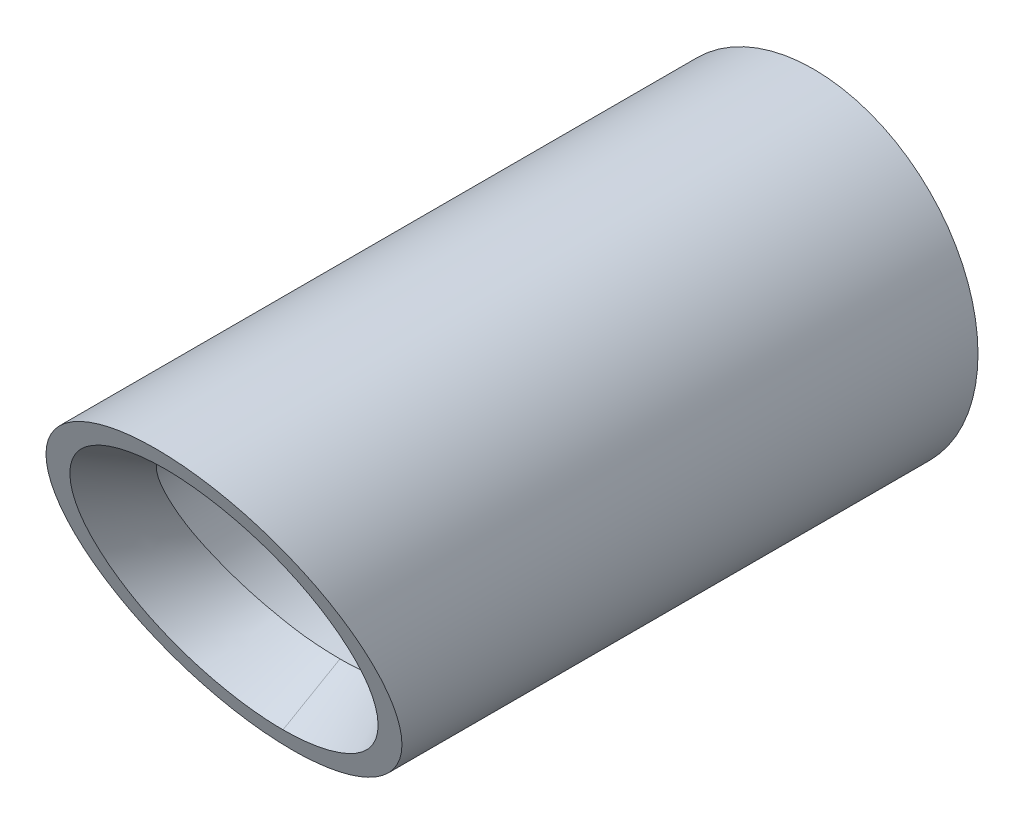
ISO-10303-21;
HEADER;
FILE_DESCRIPTION(('STEP AP214'),'2;1');
FILE_NAME('part.step','',(''),(''),'','','');
FILE_SCHEMA(('AUTOMOTIVE_DESIGN { 1 0 10303 214 1 1 1 1 }'));
ENDSEC;
DATA;
#1=APPLICATION_CONTEXT('core data for automotive mechanical design processes');
#2=APPLICATION_PROTOCOL_DEFINITION('international standard','automotive_design',2000,#1);
#3=PRODUCT_CONTEXT('',#1,'mechanical');
#4=PRODUCT('Part','Part','',(#3));
#5=PRODUCT_RELATED_PRODUCT_CATEGORY('part','',(#4));
#6=PRODUCT_DEFINITION_FORMATION('','',#4);
#7=PRODUCT_DEFINITION_CONTEXT('part definition',#1,'design');
#8=PRODUCT_DEFINITION('design','',#6,#7);
#9=PRODUCT_DEFINITION_SHAPE('','',#8);
#10=(LENGTH_UNIT() NAMED_UNIT(*) SI_UNIT(.MILLI.,.METRE.));
#11=(NAMED_UNIT(*) PLANE_ANGLE_UNIT() SI_UNIT($,.RADIAN.));
#12=(NAMED_UNIT(*) SI_UNIT($,.STERADIAN.) SOLID_ANGLE_UNIT());
#13=UNCERTAINTY_MEASURE_WITH_UNIT(LENGTH_MEASURE(1.E-05),#10,'distance_accuracy_value','');
#14=(GEOMETRIC_REPRESENTATION_CONTEXT(3) GLOBAL_UNCERTAINTY_ASSIGNED_CONTEXT((#13)) GLOBAL_UNIT_ASSIGNED_CONTEXT((#10,
#11,#12)) REPRESENTATION_CONTEXT('',''));
#15=CARTESIAN_POINT('',(0.,0.,0.));
#16=DIRECTION('',(0.,0.,1.));
#17=DIRECTION('',(1.,0.,0.));
#18=AXIS2_PLACEMENT_3D('',#15,#16,#17);
#19=CARTESIAN_POINT('',(55.3029326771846,7.5,30.));
#20=DIRECTION('',(0.,0.38268343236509,-0.923879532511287));
#21=DIRECTION('',(0.,0.923879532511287,0.38268343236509));
#22=AXIS2_PLACEMENT_3D('',#19,#20,#21);
#23=PLANE('',#22);
#24=CARTESIAN_POINT('',(0.,0.,26.8933982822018));
#25=DIRECTION('',(0.,0.38268343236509,-0.923879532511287));
#26=DIRECTION('',(0.,-0.923879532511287,-0.38268343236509));
#27=AXIS2_PLACEMENT_3D('',#24,#25,#26);
#28=ELLIPSE('',#27,8.11794150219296,7.5);
#29=CARTESIAN_POINT('',(0.,-7.5,23.7867965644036));
#30=VERTEX_POINT('',#29);
#31=EDGE_CURVE('E249',#30,#30,#28,.T.);
#32=ORIENTED_EDGE('',*,*,#31,.F.);
#33=EDGE_LOOP('',(#32));
#34=FACE_BOUND('',#33,.T.);
#35=CARTESIAN_POINT('',(0.,6.50000000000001,29.5857864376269));
#36=CARTESIAN_POINT('',(-0.0720385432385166,6.50000029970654,29.5857865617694));
#37=CARTESIAN_POINT('',(-0.144075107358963,6.49872447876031,29.5852580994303));
#38=CARTESIAN_POINT('',(-0.288061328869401,6.49366728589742,29.583163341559));
#39=CARTESIAN_POINT('',(-0.360010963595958,6.48988536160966,29.5815968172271));
#40=CARTESIAN_POINT('',(-0.503735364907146,6.47986082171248,29.5774445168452));
#41=CARTESIAN_POINT('',(-0.575510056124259,6.47361728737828,29.5748583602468));
#42=CARTESIAN_POINT('',(-0.718798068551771,6.45871463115,29.5686854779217));
#43=CARTESIAN_POINT('',(-0.790311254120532,6.45005439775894,29.5650982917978));
#44=CARTESIAN_POINT('',(-0.932989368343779,6.43036315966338,29.5569419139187));
#45=CARTESIAN_POINT('',(-1.00415411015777,6.41933100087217,29.5523722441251));
#46=CARTESIAN_POINT('',(-1.14604853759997,6.3949406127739,29.5422694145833));
#47=CARTESIAN_POINT('',(-1.21677800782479,6.38158131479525,29.5367358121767));
#48=CARTESIAN_POINT('',(-1.35771503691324,6.35258121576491,29.5247235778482));
#49=CARTESIAN_POINT('',(-1.42792238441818,6.33693953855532,29.5182445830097));
#50=CARTESIAN_POINT('',(-1.56772828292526,6.30341914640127,29.5043599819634));
#51=CARTESIAN_POINT('',(-1.63732666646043,6.28553983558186,29.4969541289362));
#52=CARTESIAN_POINT('',(-1.77582770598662,6.2475885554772,29.4812341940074));
#53=CARTESIAN_POINT('',(-1.84473028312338,6.2275163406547,29.4729200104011));
#54=CARTESIAN_POINT('',(-1.98175273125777,6.18522356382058,29.4554017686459));
#55=CARTESIAN_POINT('',(-2.04987265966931,6.16300316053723,29.4461977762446));
#56=CARTESIAN_POINT('',(-2.18524278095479,6.11645826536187,29.4269182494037));
#57=CARTESIAN_POINT('',(-2.25249321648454,6.09213437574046,29.4168429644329));
#58=CARTESIAN_POINT('',(-2.38603727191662,6.0414267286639,29.3958391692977));
#59=CARTESIAN_POINT('',(-2.45233136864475,6.01504404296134,29.3849111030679));
#60=CARTESIAN_POINT('',(-2.58387561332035,5.96026299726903,29.3622200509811));
#61=CARTESIAN_POINT('',(-2.64912651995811,5.93186619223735,29.350457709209));
#62=CARTESIAN_POINT('',(-2.77849721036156,5.87310109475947,29.3261164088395));
#63=CARTESIAN_POINT('',(-2.84261808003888,5.84273484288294,29.3135382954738));
#64=CARTESIAN_POINT('',(-2.96964144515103,5.78007501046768,29.2875837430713));
#65=CARTESIAN_POINT('',(-3.03254539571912,5.74778394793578,29.2742083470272));
#66=CARTESIAN_POINT('',(-3.15704774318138,5.68131875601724,29.2466775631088));
#67=CARTESIAN_POINT('',(-3.21864800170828,5.64714760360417,29.2325234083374));
#68=CARTESIAN_POINT('',(-3.3404637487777,5.57696130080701,29.203451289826));
#69=CARTESIAN_POINT('',(-3.40068136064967,5.54094929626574,29.1885346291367));
#70=CARTESIAN_POINT('',(-3.51969547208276,5.46711435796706,29.1579511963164));
#71=CARTESIAN_POINT('',(-3.57849360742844,5.4292936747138,29.1422853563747));
#72=CARTESIAN_POINT('',(-3.6946417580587,5.35187039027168,29.1102155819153));
#73=CARTESIAN_POINT('',(-3.75199267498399,5.31226894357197,29.0938121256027));
#74=CARTESIAN_POINT('',(-3.86521933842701,5.23131297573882,29.0602790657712));
#75=CARTESIAN_POINT('',(-3.92109519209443,5.18995858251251,29.0431495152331));
#76=CARTESIAN_POINT('',(-4.03134476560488,5.10552552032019,29.0081761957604));
#77=CARTESIAN_POINT('',(-4.08571774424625,5.06244602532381,28.9903320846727));
#78=CARTESIAN_POINT('',(-4.19293464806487,4.97459147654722,28.9539415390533));
#79=CARTESIAN_POINT('',(-4.2457769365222,4.9298147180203,28.9353943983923));
#80=CARTESIAN_POINT('',(-4.34990558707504,4.83859428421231,28.8976096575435));
#81=CARTESIAN_POINT('',(-4.40118937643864,4.79214810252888,28.8783710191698));
#82=CARTESIAN_POINT('',(-4.502174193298,4.69761738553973,28.839215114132));
#83=CARTESIAN_POINT('',(-4.55187167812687,4.64952962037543,28.8192965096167));
#84=CARTESIAN_POINT('',(-4.64965708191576,4.55174422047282,28.778792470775));
#85=CARTESIAN_POINT('',(-4.69774046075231,4.5020427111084,28.7582054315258));
#86=CARTESIAN_POINT('',(-4.79227087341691,4.40105822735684,28.7163762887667));
#87=CARTESIAN_POINT('',(-4.83871234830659,4.34977081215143,28.6951323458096));
#88=CARTESIAN_POINT('',(-4.92993219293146,4.2456428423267,28.6520011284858));
#89=CARTESIAN_POINT('',(-4.97470396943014,4.19279735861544,28.6301118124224));
#90=CARTESIAN_POINT('',(-5.06255766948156,4.08558149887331,28.5857015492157));
#91=CARTESIAN_POINT('',(-5.10563195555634,4.03120578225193,28.5631783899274));
#92=CARTESIAN_POINT('',(-5.19006393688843,3.92095762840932,28.5175121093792));
#93=CARTESIAN_POINT('',(-5.23141294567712,3.86507951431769,28.4943666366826));
#94=CARTESIAN_POINT('',(-5.3123676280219,3.75185465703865,28.4474673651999));
#95=CARTESIAN_POINT('',(-5.35196356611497,3.69450197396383,28.4237111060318));
#96=CARTESIAN_POINT('',(-5.42938539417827,3.5783560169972,28.3756018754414));
#97=CARTESIAN_POINT('',(-5.4672005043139,3.51955661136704,28.3512463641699));
#98=CARTESIAN_POINT('',(-5.54103382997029,3.40054510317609,28.3019501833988));
#99=CARTESIAN_POINT('',(-5.57704022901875,3.34032674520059,28.2770069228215));
#100=CARTESIAN_POINT('',(-5.64722468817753,3.21851422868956,28.2265505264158));
#101=CARTESIAN_POINT('',(-5.68139020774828,3.15691390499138,28.2010348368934));
#102=CARTESIAN_POINT('',(-5.74785330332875,3.03241547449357,28.1494658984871));
#103=CARTESIAN_POINT('',(-5.78013890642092,2.96951191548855,28.1234103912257));
#104=CARTESIAN_POINT('',(-5.8427968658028,2.84249234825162,28.0707971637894));
#105=CARTESIAN_POINT('',(-5.87315814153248,2.77837167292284,28.0442375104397));
#106=CARTESIAN_POINT('',(-5.93192070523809,2.64900645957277,27.9906526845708));
#107=CARTESIAN_POINT('',(-5.96031181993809,2.58375798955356,27.9636258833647));
#108=CARTESIAN_POINT('',(-6.04264281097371,2.3860599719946,27.8817366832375));
#109=CARTESIAN_POINT('',(-6.09335057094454,2.25244886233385,27.8263931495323));
#110=CARTESIAN_POINT('',(-6.18641923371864,1.98176969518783,27.7142741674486));
#111=CARTESIAN_POINT('',(-6.22872109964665,1.84468432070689,27.6574915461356));
#112=CARTESIAN_POINT('',(-6.2855641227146,1.63723757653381,27.571564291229));
#113=CARTESIAN_POINT('',(-6.3034394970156,1.5676433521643,27.5427374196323));
#114=CARTESIAN_POINT('',(-6.33695809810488,1.42784502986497,27.4848310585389));
#115=CARTESIAN_POINT('',(-6.35259665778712,1.35763997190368,27.4557511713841));
#116=CARTESIAN_POINT('',(-6.38159545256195,1.21670931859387,27.3973757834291));
#117=CARTESIAN_POINT('',(-6.39495187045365,1.14598305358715,27.3680800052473));
#118=CARTESIAN_POINT('',(-6.41934101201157,1.00409585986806,27.3093084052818));
#119=CARTESIAN_POINT('',(-6.43037072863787,0.932934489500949,27.2798324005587));
#120=CARTESIAN_POINT('',(-6.45006092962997,0.790263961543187,27.2207363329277));
#121=CARTESIAN_POINT('',(-6.45871916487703,0.71875453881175,27.1911161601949));
#122=CARTESIAN_POINT('',(-6.47362097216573,0.575474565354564,27.1317676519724));
#123=CARTESIAN_POINT('',(-6.47986298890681,0.503703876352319,27.1020392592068));
#124=CARTESIAN_POINT('',(-6.48988697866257,0.359988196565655,27.0425102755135));
#125=CARTESIAN_POINT('',(-6.49366801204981,0.288043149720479,27.0127096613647));
#126=CARTESIAN_POINT('',(-6.49872473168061,0.144065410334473,26.9530721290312));
#127=CARTESIAN_POINT('',(-6.49999999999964,0.0720327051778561,26.9232352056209));
#128=CARTESIAN_POINT('',(-6.50000000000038,-0.072032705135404,26.8635613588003));
#129=CARTESIAN_POINT('',(-6.4987247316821,-0.144065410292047,26.83372443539));
#130=CARTESIAN_POINT('',(-6.49366801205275,-0.288043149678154,26.7740869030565));
#131=CARTESIAN_POINT('',(-6.48988697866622,-0.359988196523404,26.7442862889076));
#132=CARTESIAN_POINT('',(-6.47986298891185,-0.503703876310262,26.6847573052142));
#133=CARTESIAN_POINT('',(-6.47362097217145,-0.575474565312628,26.6550289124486));
#134=CARTESIAN_POINT('',(-6.45871916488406,-0.7187545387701,26.595680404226));
#135=CARTESIAN_POINT('',(-6.45006092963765,-0.790263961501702,26.5660602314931));
#136=CARTESIAN_POINT('',(-6.43037072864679,-0.932934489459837,26.5069641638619));
#137=CARTESIAN_POINT('',(-6.4193410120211,-1.00409585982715,26.4774881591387));
#138=CARTESIAN_POINT('',(-6.39495187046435,-1.14598305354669,26.418716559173));
#139=CARTESIAN_POINT('',(-6.38159545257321,-1.21670931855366,26.3894207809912));
#140=CARTESIAN_POINT('',(-6.35259665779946,-1.357639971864,26.3310453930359));
#141=CARTESIAN_POINT('',(-6.33695809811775,-1.42784502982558,26.301965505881));
#142=CARTESIAN_POINT('',(-6.30343949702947,-1.5676433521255,26.2440591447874));
#143=CARTESIAN_POINT('',(-6.28556412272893,-1.63723757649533,26.2152322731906));
#144=CARTESIAN_POINT('',(-6.22872109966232,-1.84468432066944,26.1293050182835));
#145=CARTESIAN_POINT('',(-6.1864192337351,-1.98176969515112,26.0725223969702));
#146=CARTESIAN_POINT('',(-6.09335057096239,-2.2524488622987,25.9604034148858));
#147=CARTESIAN_POINT('',(-6.04264281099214,-2.38605997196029,25.9050598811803));
#148=CARTESIAN_POINT('',(-5.96031181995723,-2.58375798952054,25.8231706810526));
#149=CARTESIAN_POINT('',(-5.93192070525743,-2.64900645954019,25.7961438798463));
#150=CARTESIAN_POINT('',(-5.87315814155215,-2.77837167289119,25.7425590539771));
#151=CARTESIAN_POINT('',(-5.84279686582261,-2.84249234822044,25.7159994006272));
#152=CARTESIAN_POINT('',(-5.78013890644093,-2.96951191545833,25.6633861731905));
#153=CARTESIAN_POINT('',(-5.74785330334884,-3.03241547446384,25.6373306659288));
#154=CARTESIAN_POINT('',(-5.68139020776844,-3.15691390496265,25.5857617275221));
#155=CARTESIAN_POINT('',(-5.64722468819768,-3.21851422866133,25.5602460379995));
#156=CARTESIAN_POINT('',(-5.57704022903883,-3.34032674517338,25.5097896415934));
#157=CARTESIAN_POINT('',(-5.54103382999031,-3.40054510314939,25.4848463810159));
#158=CARTESIAN_POINT('',(-5.4672005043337,-3.51955661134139,25.4355502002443));
#159=CARTESIAN_POINT('',(-5.42938539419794,-3.57835601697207,25.4111946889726));
#160=CARTESIAN_POINT('',(-5.35196356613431,-3.69450197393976,25.3630854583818));
#161=CARTESIAN_POINT('',(-5.31236762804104,-3.75185465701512,25.3393291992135));
#162=CARTESIAN_POINT('',(-5.23141294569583,-3.86507951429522,25.2924299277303));
#163=CARTESIAN_POINT('',(-5.19006393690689,-3.92095762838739,25.2692844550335));
#164=CARTESIAN_POINT('',(-5.10563195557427,-4.03120578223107,25.2236181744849));
#165=CARTESIAN_POINT('',(-5.0625576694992,-4.08558149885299,25.2010950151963));
#166=CARTESIAN_POINT('',(-4.97470396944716,-4.19279735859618,25.1566847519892));
#167=CARTESIAN_POINT('',(-4.92993219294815,-4.24564284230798,25.1347954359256));
#168=CARTESIAN_POINT('',(-4.83871234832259,-4.34977081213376,25.0916642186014));
#169=CARTESIAN_POINT('',(-4.79227087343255,-4.4010582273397,25.070420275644));
#170=CARTESIAN_POINT('',(-4.69774046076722,-4.5020427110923,25.0285911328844));
#171=CARTESIAN_POINT('',(-4.64965708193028,-4.55174422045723,25.0080040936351));
#172=CARTESIAN_POINT('',(-4.55187167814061,-4.64952962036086,24.9675000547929));
#173=CARTESIAN_POINT('',(-4.50217419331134,-4.69761738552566,24.9475814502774));
#174=CARTESIAN_POINT('',(-4.40118937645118,-4.7921481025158,24.9084255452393));
#175=CARTESIAN_POINT('',(-4.34990558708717,-4.83859428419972,24.8891869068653));
#176=CARTESIAN_POINT('',(-4.24577693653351,-4.92981471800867,24.8514021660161));
#177=CARTESIAN_POINT('',(-4.19293464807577,-4.97459147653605,24.832855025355));
#178=CARTESIAN_POINT('',(-4.08571774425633,-5.06244602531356,24.7964644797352));
#179=CARTESIAN_POINT('',(-4.03134476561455,-5.10552552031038,24.7786203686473));
#180=CARTESIAN_POINT('',(-3.92109519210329,-5.18995858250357,24.7436470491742));
#181=CARTESIAN_POINT('',(-3.86521933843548,-5.2313129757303,24.726517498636));
#182=CARTESIAN_POINT('',(-3.75199267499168,-5.31226894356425,24.6929844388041));
#183=CARTESIAN_POINT('',(-3.69464175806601,-5.35187039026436,24.6765809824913));
#184=CARTESIAN_POINT('',(-3.57849360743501,-5.42929367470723,24.6445112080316));
#185=CARTESIAN_POINT('',(-3.51969547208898,-5.46711435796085,24.6288453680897));
#186=CARTESIAN_POINT('',(-3.40068136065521,-5.54094929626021,24.5982619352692));
#187=CARTESIAN_POINT('',(-3.34046374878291,-5.57696130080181,24.5833452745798));
#188=CARTESIAN_POINT('',(-3.21864800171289,-5.64714760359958,24.5542731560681));
#189=CARTESIAN_POINT('',(-3.1570477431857,-5.68131875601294,24.5401190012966));
#190=CARTESIAN_POINT('',(-3.0325453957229,-5.74778394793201,24.512588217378));
#191=CARTESIAN_POINT('',(-2.96964144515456,-5.78007501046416,24.4992128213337));
#192=CARTESIAN_POINT('',(-2.84261808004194,-5.84273484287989,24.4732582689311));
#193=CARTESIAN_POINT('',(-2.7784972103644,-5.87310109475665,24.4606801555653));
#194=CARTESIAN_POINT('',(-2.64912651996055,-5.93186619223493,24.4363388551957));
#195=CARTESIAN_POINT('',(-2.58387561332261,-5.96026299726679,24.4245765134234));
#196=CARTESIAN_POINT('',(-2.45233136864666,-6.01504404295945,24.4018854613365));
#197=CARTESIAN_POINT('',(-2.38603727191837,-6.04142672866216,24.3909573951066));
#198=CARTESIAN_POINT('',(-2.252493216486,-6.09213437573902,24.3699535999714));
#199=CARTESIAN_POINT('',(-2.18524278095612,-6.11645826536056,24.3598783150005));
#200=CARTESIAN_POINT('',(-2.04987265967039,-6.16300316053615,24.3405987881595));
#201=CARTESIAN_POINT('',(-1.98175273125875,-6.18522356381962,24.3313947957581));
#202=CARTESIAN_POINT('',(-1.84473028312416,-6.22751634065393,24.3138765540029));
#203=CARTESIAN_POINT('',(-1.77582770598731,-6.24758855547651,24.3055623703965));
#204=CARTESIAN_POINT('',(-1.63732666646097,-6.28553983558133,24.2898424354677));
#205=CARTESIAN_POINT('',(-1.56772828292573,-6.3034191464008,24.2824365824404));
#206=CARTESIAN_POINT('',(-1.42792238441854,-6.33693953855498,24.268551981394));
#207=CARTESIAN_POINT('',(-1.35771503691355,-6.35258121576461,24.2620729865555));
#208=CARTESIAN_POINT('',(-1.21677800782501,-6.38158131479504,24.250060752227));
#209=CARTESIAN_POINT('',(-1.14604853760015,-6.39494061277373,24.2445271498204));
#210=CARTESIAN_POINT('',(-1.0041541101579,-6.41933100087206,24.2344243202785));
#211=CARTESIAN_POINT('',(-0.932989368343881,-6.43036315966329,24.229854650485));
#212=CARTESIAN_POINT('',(-0.790311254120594,-6.45005439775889,24.2216982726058));
#213=CARTESIAN_POINT('',(-0.718798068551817,-6.45871463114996,24.2181110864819));
#214=CARTESIAN_POINT('',(-0.575510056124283,-6.47361728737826,24.2119382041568));
#215=CARTESIAN_POINT('',(-0.503735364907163,-6.47986082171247,24.2093520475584));
#216=CARTESIAN_POINT('',(-0.360010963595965,-6.48988536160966,24.2051997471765));
#217=CARTESIAN_POINT('',(-0.288061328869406,-6.49366728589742,24.2036332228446));
#218=CARTESIAN_POINT('',(-0.144075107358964,-6.49872447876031,24.2015384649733));
#219=CARTESIAN_POINT('',(-0.0720385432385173,-6.50000029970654,24.2010100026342));
#220=CARTESIAN_POINT('',(0.,-6.50000000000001,24.2010101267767));
#221=B_SPLINE_CURVE_WITH_KNOTS('',3,(#35,#36,#37,#38,#39,#40,#41,#42,#43,#44,#45,#46,#47,#48,
#49,#50,#51,#52,#53,#54,#55,#56,#57,#58,#59,#60,#61,#62,#63,#64,#65,#66,#67,#68,#69,#70,#71,#72,
#73,#74,#75,#76,#77,#78,#79,#80,#81,#82,#83,#84,#85,#86,#87,#88,#89,#90,#91,#92,#93,#94,#95,#96,
#97,#98,#99,#100,#101,#102,#103,#104,#105,#106,#107,#108,#109,#110,#111,#112,#113,#114,#115,
#116,#117,#118,#119,#120,#121,#122,#123,#124,#125,#126,#127,#128,#129,#130,#131,#132,#133,#134,
#135,#136,#137,#138,#139,#140,#141,#142,#143,#144,#145,#146,#147,#148,#149,#150,#151,#152,#153,
#154,#155,#156,#157,#158,#159,#160,#161,#162,#163,#164,#165,#166,#167,#168,#169,#170,#171,#172,
#173,#174,#175,#176,#177,#178,#179,#180,#181,#182,#183,#184,#185,#186,#187,#188,#189,#190,#191,
#192,#193,#194,#195,#196,#197,#198,#199,#200,#201,#202,#203,#204,#205,#206,#207,#208,#209,#210,
#211,#212,#213,#214,#215,#216,#217,#218,#219,#220),.UNSPECIFIED.,.F.,.F.,(4,2,2,2,2,2,2,2,2,2,2,
2,2,2,2,2,2,2,2,2,2,2,2,2,2,2,2,2,2,2,2,2,2,2,2,2,2,2,2,2,2,2,2,2,2,2,2,2,2,2,2,2,2,2,2,2,2,2,2,
2,2,2,2,2,2,2,2,2,2,2,2,2,2,2,2,2,2,2,2,2,2,2,2,2,2,2,2,2,2,2,2,2,4),(0.,0.216099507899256,
0.432246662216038,0.648474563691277,0.864802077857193,1.08123508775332,1.29776775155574,
1.51438375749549,1.73105757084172,1.9477556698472,2.16443776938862,2.3810580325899,
2.59756627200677,2.81390914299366,3.03003133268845,3.24587674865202,3.46138971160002,
3.67654595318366,3.89144111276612,4.10619890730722,4.32094105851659,4.53578729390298,
4.75085535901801,4.96626104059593,5.18211820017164,5.39853881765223,5.61563304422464,
5.83350926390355,6.05227416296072,6.27203280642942,6.4928887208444,6.71494398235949,
6.93829930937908,7.16302181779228,7.38904667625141,7.6162728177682,7.84459628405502,
8.30406086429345,8.76664642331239,8.99887776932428,9.23158680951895,9.46468135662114,
9.69807533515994,9.9316899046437,10.1654546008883,10.3993084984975,10.6332013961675,
10.8670942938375,11.1009481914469,11.3347128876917,11.5683274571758,11.801721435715,
12.0348159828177,12.2675250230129,12.4997563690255,12.9623419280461,13.4218065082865,
13.6501299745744,13.8773561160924,14.1033809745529,14.3281034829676,14.5514588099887,
14.7735140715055,14.9943699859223,15.2141286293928,15.4328935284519,15.6507697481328,
15.8678639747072,16.0842845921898,16.3001417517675,16.5155474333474,16.7306154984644,
16.9454617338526,17.1602038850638,17.3749616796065,17.5898568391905,17.8050130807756,
18.0205260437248,18.2363714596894,18.4524936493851,18.6688365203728,18.8853447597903,
19.1019650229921,19.3186471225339,19.5353452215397,19.7520190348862,19.9686350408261,
20.1851677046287,20.4016007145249,20.6179282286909,20.8341561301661,21.0503032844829,
21.2664027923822),.UNSPECIFIED.);
#222=CARTESIAN_POINT('',(0.,-6.5,24.2010101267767));
#223=VERTEX_POINT('',#222);
#224=CARTESIAN_POINT('',(0.,6.5,29.5857864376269));
#225=VERTEX_POINT('',#224);
#226=EDGE_CURVE('E207',#223,#225,#221,.F.);
#227=ORIENTED_EDGE('',*,*,#226,.T.);
#228=CARTESIAN_POINT('',(0.,-6.50000000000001,24.2010101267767));
#229=CARTESIAN_POINT('',(0.0720385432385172,-6.50000029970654,24.2010100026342));
#230=CARTESIAN_POINT('',(0.144075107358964,-6.49872447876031,24.2015384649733));
#231=CARTESIAN_POINT('',(0.288061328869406,-6.49366728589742,24.2036332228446));
#232=CARTESIAN_POINT('',(0.360010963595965,-6.48988536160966,24.2051997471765));
#233=CARTESIAN_POINT('',(0.503735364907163,-6.47986082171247,24.2093520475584));
#234=CARTESIAN_POINT('',(0.575510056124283,-6.47361728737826,24.2119382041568));
#235=CARTESIAN_POINT('',(0.718798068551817,-6.45871463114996,24.2181110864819));
#236=CARTESIAN_POINT('',(0.790311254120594,-6.45005439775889,24.2216982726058));
#237=CARTESIAN_POINT('',(0.932989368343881,-6.43036315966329,24.229854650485));
#238=CARTESIAN_POINT('',(1.0041541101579,-6.41933100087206,24.2344243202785));
#239=CARTESIAN_POINT('',(1.14604853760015,-6.39494061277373,24.2445271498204));
#240=CARTESIAN_POINT('',(1.21677800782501,-6.38158131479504,24.250060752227));
#241=CARTESIAN_POINT('',(1.35771503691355,-6.35258121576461,24.2620729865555));
#242=CARTESIAN_POINT('',(1.42792238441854,-6.33693953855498,24.268551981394));
#243=CARTESIAN_POINT('',(1.56772828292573,-6.3034191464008,24.2824365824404));
#244=CARTESIAN_POINT('',(1.63732666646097,-6.28553983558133,24.2898424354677));
#245=CARTESIAN_POINT('',(1.77582770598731,-6.24758855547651,24.3055623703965));
#246=CARTESIAN_POINT('',(1.84473028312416,-6.22751634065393,24.3138765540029));
#247=CARTESIAN_POINT('',(1.98175273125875,-6.18522356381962,24.3313947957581));
#248=CARTESIAN_POINT('',(2.04987265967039,-6.16300316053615,24.3405987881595));
#249=CARTESIAN_POINT('',(2.18524278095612,-6.11645826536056,24.3598783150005));
#250=CARTESIAN_POINT('',(2.252493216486,-6.09213437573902,24.3699535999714));
#251=CARTESIAN_POINT('',(2.38603727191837,-6.04142672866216,24.3909573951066));
#252=CARTESIAN_POINT('',(2.45233136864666,-6.01504404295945,24.4018854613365));
#253=CARTESIAN_POINT('',(2.58387561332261,-5.96026299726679,24.4245765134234));
#254=CARTESIAN_POINT('',(2.64912651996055,-5.93186619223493,24.4363388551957));
#255=CARTESIAN_POINT('',(2.7784972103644,-5.87310109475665,24.4606801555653));
#256=CARTESIAN_POINT('',(2.84261808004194,-5.84273484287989,24.4732582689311));
#257=CARTESIAN_POINT('',(2.96964144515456,-5.78007501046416,24.4992128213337));
#258=CARTESIAN_POINT('',(3.0325453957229,-5.74778394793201,24.512588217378));
#259=CARTESIAN_POINT('',(3.1570477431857,-5.68131875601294,24.5401190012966));
#260=CARTESIAN_POINT('',(3.21864800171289,-5.64714760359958,24.5542731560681));
#261=CARTESIAN_POINT('',(3.34046374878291,-5.57696130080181,24.5833452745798));
#262=CARTESIAN_POINT('',(3.40068136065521,-5.54094929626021,24.5982619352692));
#263=CARTESIAN_POINT('',(3.51969547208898,-5.46711435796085,24.6288453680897));
#264=CARTESIAN_POINT('',(3.57849360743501,-5.42929367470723,24.6445112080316));
#265=CARTESIAN_POINT('',(3.69464175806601,-5.35187039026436,24.6765809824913));
#266=CARTESIAN_POINT('',(3.75199267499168,-5.31226894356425,24.6929844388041));
#267=CARTESIAN_POINT('',(3.86521933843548,-5.2313129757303,24.726517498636));
#268=CARTESIAN_POINT('',(3.92109519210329,-5.18995858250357,24.7436470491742));
#269=CARTESIAN_POINT('',(4.03134476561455,-5.10552552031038,24.7786203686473));
#270=CARTESIAN_POINT('',(4.08571774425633,-5.06244602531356,24.7964644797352));
#271=CARTESIAN_POINT('',(4.19293464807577,-4.97459147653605,24.832855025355));
#272=CARTESIAN_POINT('',(4.24577693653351,-4.92981471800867,24.8514021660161));
#273=CARTESIAN_POINT('',(4.34990558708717,-4.83859428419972,24.8891869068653));
#274=CARTESIAN_POINT('',(4.40118937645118,-4.7921481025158,24.9084255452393));
#275=CARTESIAN_POINT('',(4.50217419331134,-4.69761738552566,24.9475814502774));
#276=CARTESIAN_POINT('',(4.55187167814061,-4.64952962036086,24.9675000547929));
#277=CARTESIAN_POINT('',(4.64965708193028,-4.55174422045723,25.0080040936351));
#278=CARTESIAN_POINT('',(4.69774046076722,-4.5020427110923,25.0285911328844));
#279=CARTESIAN_POINT('',(4.79227087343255,-4.4010582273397,25.070420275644));
#280=CARTESIAN_POINT('',(4.83871234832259,-4.34977081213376,25.0916642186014));
#281=CARTESIAN_POINT('',(4.92993219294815,-4.24564284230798,25.1347954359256));
#282=CARTESIAN_POINT('',(4.97470396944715,-4.19279735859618,25.1566847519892));
#283=CARTESIAN_POINT('',(5.0625576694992,-4.08558149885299,25.2010950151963));
#284=CARTESIAN_POINT('',(5.10563195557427,-4.03120578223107,25.2236181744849));
#285=CARTESIAN_POINT('',(5.19006393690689,-3.92095762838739,25.2692844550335));
#286=CARTESIAN_POINT('',(5.23141294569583,-3.86507951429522,25.2924299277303));
#287=CARTESIAN_POINT('',(5.31236762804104,-3.75185465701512,25.3393291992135));
#288=CARTESIAN_POINT('',(5.35196356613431,-3.69450197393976,25.3630854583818));
#289=CARTESIAN_POINT('',(5.42938539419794,-3.57835601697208,25.4111946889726));
#290=CARTESIAN_POINT('',(5.4672005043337,-3.51955661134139,25.4355502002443));
#291=CARTESIAN_POINT('',(5.54103382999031,-3.4005451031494,25.4848463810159));
#292=CARTESIAN_POINT('',(5.57704022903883,-3.34032674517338,25.5097896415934));
#293=CARTESIAN_POINT('',(5.64722468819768,-3.21851422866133,25.5602460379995));
#294=CARTESIAN_POINT('',(5.68139020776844,-3.15691390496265,25.5857617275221));
#295=CARTESIAN_POINT('',(5.74785330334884,-3.03241547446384,25.6373306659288));
#296=CARTESIAN_POINT('',(5.78013890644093,-2.96951191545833,25.6633861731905));
#297=CARTESIAN_POINT('',(5.84279686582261,-2.84249234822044,25.7159994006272));
#298=CARTESIAN_POINT('',(5.87315814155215,-2.7783716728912,25.7425590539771));
#299=CARTESIAN_POINT('',(5.93192070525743,-2.64900645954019,25.7961438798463));
#300=CARTESIAN_POINT('',(5.96031181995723,-2.58375798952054,25.8231706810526));
#301=CARTESIAN_POINT('',(6.04264281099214,-2.38605997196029,25.9050598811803));
#302=CARTESIAN_POINT('',(6.09335057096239,-2.2524488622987,25.9604034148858));
#303=CARTESIAN_POINT('',(6.1864192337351,-1.98176969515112,26.0725223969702));
#304=CARTESIAN_POINT('',(6.22872109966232,-1.84468432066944,26.1293050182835));
#305=CARTESIAN_POINT('',(6.28556412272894,-1.63723757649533,26.2152322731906));
#306=CARTESIAN_POINT('',(6.30343949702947,-1.5676433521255,26.2440591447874));
#307=CARTESIAN_POINT('',(6.33695809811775,-1.42784502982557,26.301965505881));
#308=CARTESIAN_POINT('',(6.35259665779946,-1.357639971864,26.3310453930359));
#309=CARTESIAN_POINT('',(6.38159545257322,-1.21670931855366,26.3894207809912));
#310=CARTESIAN_POINT('',(6.39495187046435,-1.14598305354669,26.418716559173));
#311=CARTESIAN_POINT('',(6.4193410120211,-1.00409585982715,26.4774881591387));
#312=CARTESIAN_POINT('',(6.43037072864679,-0.932934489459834,26.5069641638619));
#313=CARTESIAN_POINT('',(6.45006092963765,-0.790263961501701,26.5660602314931));
#314=CARTESIAN_POINT('',(6.45871916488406,-0.718754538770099,26.595680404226));
#315=CARTESIAN_POINT('',(6.47362097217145,-0.575474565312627,26.6550289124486));
#316=CARTESIAN_POINT('',(6.47986298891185,-0.50370387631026,26.6847573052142));
#317=CARTESIAN_POINT('',(6.48988697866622,-0.359988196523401,26.7442862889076));
#318=CARTESIAN_POINT('',(6.49366801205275,-0.288043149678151,26.7740869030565));
#319=CARTESIAN_POINT('',(6.4987247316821,-0.144065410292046,26.83372443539));
#320=CARTESIAN_POINT('',(6.50000000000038,-0.0720327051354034,26.8635613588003));
#321=CARTESIAN_POINT('',(6.49999999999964,0.0720327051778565,26.9232352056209));
#322=CARTESIAN_POINT('',(6.49872473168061,0.144065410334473,26.9530721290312));
#323=CARTESIAN_POINT('',(6.49366801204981,0.28804314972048,27.0127096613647));
#324=CARTESIAN_POINT('',(6.48988697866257,0.359988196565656,27.0425102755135));
#325=CARTESIAN_POINT('',(6.47986298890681,0.50370387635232,27.1020392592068));
#326=CARTESIAN_POINT('',(6.47362097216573,0.575474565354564,27.1317676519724));
#327=CARTESIAN_POINT('',(6.45871916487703,0.71875453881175,27.1911161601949));
#328=CARTESIAN_POINT('',(6.45006092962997,0.790263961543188,27.2207363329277));
#329=CARTESIAN_POINT('',(6.43037072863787,0.932934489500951,27.2798324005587));
#330=CARTESIAN_POINT('',(6.41934101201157,1.00409585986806,27.3093084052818));
#331=CARTESIAN_POINT('',(6.39495187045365,1.14598305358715,27.3680800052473));
#332=CARTESIAN_POINT('',(6.38159545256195,1.21670931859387,27.3973757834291));
#333=CARTESIAN_POINT('',(6.35259665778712,1.35763997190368,27.4557511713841));
#334=CARTESIAN_POINT('',(6.33695809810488,1.42784502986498,27.4848310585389));
#335=CARTESIAN_POINT('',(6.3034394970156,1.5676433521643,27.5427374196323));
#336=CARTESIAN_POINT('',(6.2855641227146,1.63723757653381,27.571564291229));
#337=CARTESIAN_POINT('',(6.22872109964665,1.84468432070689,27.6574915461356));
#338=CARTESIAN_POINT('',(6.18641923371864,1.98176969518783,27.7142741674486));
#339=CARTESIAN_POINT('',(6.09335057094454,2.25244886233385,27.8263931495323));
#340=CARTESIAN_POINT('',(6.04264281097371,2.3860599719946,27.8817366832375));
#341=CARTESIAN_POINT('',(5.96031181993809,2.58375798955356,27.9636258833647));
#342=CARTESIAN_POINT('',(5.93192070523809,2.64900645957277,27.9906526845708));
#343=CARTESIAN_POINT('',(5.87315814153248,2.77837167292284,28.0442375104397));
#344=CARTESIAN_POINT('',(5.8427968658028,2.84249234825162,28.0707971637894));
#345=CARTESIAN_POINT('',(5.78013890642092,2.96951191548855,28.1234103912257));
#346=CARTESIAN_POINT('',(5.74785330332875,3.03241547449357,28.1494658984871));
#347=CARTESIAN_POINT('',(5.68139020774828,3.15691390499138,28.2010348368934));
#348=CARTESIAN_POINT('',(5.64722468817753,3.21851422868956,28.2265505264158));
#349=CARTESIAN_POINT('',(5.57704022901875,3.34032674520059,28.2770069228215));
#350=CARTESIAN_POINT('',(5.5410338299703,3.40054510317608,28.3019501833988));
#351=CARTESIAN_POINT('',(5.4672005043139,3.51955661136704,28.3512463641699));
#352=CARTESIAN_POINT('',(5.42938539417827,3.5783560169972,28.3756018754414));
#353=CARTESIAN_POINT('',(5.35196356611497,3.69450197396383,28.4237111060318));
#354=CARTESIAN_POINT('',(5.3123676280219,3.75185465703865,28.4474673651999));
#355=CARTESIAN_POINT('',(5.23141294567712,3.86507951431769,28.4943666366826));
#356=CARTESIAN_POINT('',(5.19006393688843,3.92095762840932,28.5175121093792));
#357=CARTESIAN_POINT('',(5.10563195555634,4.03120578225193,28.5631783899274));
#358=CARTESIAN_POINT('',(5.06255766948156,4.08558149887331,28.5857015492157));
#359=CARTESIAN_POINT('',(4.97470396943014,4.19279735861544,28.6301118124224));
#360=CARTESIAN_POINT('',(4.92993219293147,4.2456428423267,28.6520011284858));
#361=CARTESIAN_POINT('',(4.83871234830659,4.34977081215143,28.6951323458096));
#362=CARTESIAN_POINT('',(4.79227087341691,4.40105822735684,28.7163762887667));
#363=CARTESIAN_POINT('',(4.69774046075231,4.5020427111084,28.7582054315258));
#364=CARTESIAN_POINT('',(4.64965708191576,4.55174422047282,28.778792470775));
#365=CARTESIAN_POINT('',(4.55187167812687,4.64952962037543,28.8192965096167));
#366=CARTESIAN_POINT('',(4.502174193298,4.69761738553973,28.839215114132));
#367=CARTESIAN_POINT('',(4.40118937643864,4.79214810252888,28.8783710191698));
#368=CARTESIAN_POINT('',(4.34990558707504,4.83859428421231,28.8976096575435));
#369=CARTESIAN_POINT('',(4.2457769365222,4.9298147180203,28.9353943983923));
#370=CARTESIAN_POINT('',(4.19293464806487,4.97459147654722,28.9539415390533));
#371=CARTESIAN_POINT('',(4.08571774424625,5.06244602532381,28.9903320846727));
#372=CARTESIAN_POINT('',(4.03134476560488,5.10552552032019,29.0081761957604));
#373=CARTESIAN_POINT('',(3.92109519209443,5.18995858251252,29.0431495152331));
#374=CARTESIAN_POINT('',(3.86521933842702,5.23131297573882,29.0602790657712));
#375=CARTESIAN_POINT('',(3.75199267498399,5.31226894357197,29.0938121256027));
#376=CARTESIAN_POINT('',(3.6946417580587,5.35187039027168,29.1102155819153));
#377=CARTESIAN_POINT('',(3.57849360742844,5.4292936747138,29.1422853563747));
#378=CARTESIAN_POINT('',(3.51969547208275,5.46711435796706,29.1579511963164));
#379=CARTESIAN_POINT('',(3.40068136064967,5.54094929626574,29.1885346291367));
#380=CARTESIAN_POINT('',(3.3404637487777,5.57696130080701,29.203451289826));
#381=CARTESIAN_POINT('',(3.21864800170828,5.64714760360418,29.2325234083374));
#382=CARTESIAN_POINT('',(3.15704774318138,5.68131875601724,29.2466775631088));
#383=CARTESIAN_POINT('',(3.03254539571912,5.74778394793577,29.2742083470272));
#384=CARTESIAN_POINT('',(2.96964144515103,5.78007501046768,29.2875837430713));
#385=CARTESIAN_POINT('',(2.84261808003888,5.84273484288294,29.3135382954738));
#386=CARTESIAN_POINT('',(2.77849721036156,5.87310109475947,29.3261164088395));
#387=CARTESIAN_POINT('',(2.64912651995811,5.93186619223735,29.350457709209));
#388=CARTESIAN_POINT('',(2.58387561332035,5.96026299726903,29.3622200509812));
#389=CARTESIAN_POINT('',(2.45233136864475,6.01504404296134,29.3849111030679));
#390=CARTESIAN_POINT('',(2.38603727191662,6.0414267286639,29.3958391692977));
#391=CARTESIAN_POINT('',(2.25249321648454,6.09213437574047,29.4168429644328));
#392=CARTESIAN_POINT('',(2.18524278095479,6.11645826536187,29.4269182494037));
#393=CARTESIAN_POINT('',(2.04987265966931,6.16300316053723,29.4461977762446));
#394=CARTESIAN_POINT('',(1.98175273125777,6.18522356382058,29.4554017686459));
#395=CARTESIAN_POINT('',(1.84473028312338,6.2275163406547,29.472920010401));
#396=CARTESIAN_POINT('',(1.77582770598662,6.2475885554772,29.4812341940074));
#397=CARTESIAN_POINT('',(1.63732666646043,6.28553983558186,29.4969541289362));
#398=CARTESIAN_POINT('',(1.56772828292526,6.30341914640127,29.5043599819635));
#399=CARTESIAN_POINT('',(1.42792238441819,6.33693953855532,29.5182445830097));
#400=CARTESIAN_POINT('',(1.35771503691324,6.35258121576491,29.5247235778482));
#401=CARTESIAN_POINT('',(1.21677800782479,6.38158131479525,29.5367358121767));
#402=CARTESIAN_POINT('',(1.14604853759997,6.3949406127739,29.5422694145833));
#403=CARTESIAN_POINT('',(1.00415411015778,6.41933100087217,29.5523722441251));
#404=CARTESIAN_POINT('',(0.93298936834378,6.43036315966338,29.5569419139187));
#405=CARTESIAN_POINT('',(0.790311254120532,6.45005439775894,29.5650982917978));
#406=CARTESIAN_POINT('',(0.718798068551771,6.45871463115,29.5686854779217));
#407=CARTESIAN_POINT('',(0.575510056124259,6.47361728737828,29.5748583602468));
#408=CARTESIAN_POINT('',(0.503735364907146,6.47986082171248,29.5774445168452));
#409=CARTESIAN_POINT('',(0.360010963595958,6.48988536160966,29.5815968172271));
#410=CARTESIAN_POINT('',(0.288061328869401,6.49366728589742,29.583163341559));
#411=CARTESIAN_POINT('',(0.144075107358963,6.49872447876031,29.5852580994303));
#412=CARTESIAN_POINT('',(0.0720385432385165,6.50000029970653,29.5857865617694));
#413=CARTESIAN_POINT('',(0.,6.50000000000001,29.5857864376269));
#414=B_SPLINE_CURVE_WITH_KNOTS('',3,(#228,#229,#230,#231,#232,#233,#234,#235,#236,#237,#238,
#239,#240,#241,#242,#243,#244,#245,#246,#247,#248,#249,#250,#251,#252,#253,#254,#255,#256,#257,
#258,#259,#260,#261,#262,#263,#264,#265,#266,#267,#268,#269,#270,#271,#272,#273,#274,#275,#276,
#277,#278,#279,#280,#281,#282,#283,#284,#285,#286,#287,#288,#289,#290,#291,#292,#293,#294,#295,
#296,#297,#298,#299,#300,#301,#302,#303,#304,#305,#306,#307,#308,#309,#310,#311,#312,#313,#314,
#315,#316,#317,#318,#319,#320,#321,#322,#323,#324,#325,#326,#327,#328,#329,#330,#331,#332,#333,
#334,#335,#336,#337,#338,#339,#340,#341,#342,#343,#344,#345,#346,#347,#348,#349,#350,#351,#352,
#353,#354,#355,#356,#357,#358,#359,#360,#361,#362,#363,#364,#365,#366,#367,#368,#369,#370,#371,
#372,#373,#374,#375,#376,#377,#378,#379,#380,#381,#382,#383,#384,#385,#386,#387,#388,#389,#390,
#391,#392,#393,#394,#395,#396,#397,#398,#399,#400,#401,#402,#403,#404,#405,#406,#407,#408,#409,
#410,#411,#412,#413),.UNSPECIFIED.,.F.,.F.,(4,2,2,2,2,2,2,2,2,2,2,2,2,2,2,2,2,2,2,2,2,2,2,2,2,2,
2,2,2,2,2,2,2,2,2,2,2,2,2,2,2,2,2,2,2,2,2,2,2,2,2,2,2,2,2,2,2,2,2,2,2,2,2,2,2,2,2,2,2,2,2,2,2,2,
2,2,2,2,2,2,2,2,2,2,2,2,2,2,2,2,2,2,4),(0.,0.216099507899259,0.432246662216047,
0.648474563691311,0.864802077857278,1.08123508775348,1.29776775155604,1.51438375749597,
1.73105757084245,1.94775566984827,2.16443776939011,2.38105803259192,2.59756627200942,
2.81390914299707,3.03003133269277,3.24587674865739,3.46138971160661,3.67654595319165,
3.89144111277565,4.10619890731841,4.32094105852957,4.53578729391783,4.7508553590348,
4.9662610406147,5.18211820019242,5.39853881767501,5.61563304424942,5.8335092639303,
6.05227416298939,6.27203280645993,6.49288872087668,6.71494398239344,6.9382993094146,
7.16302181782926,7.38904667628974,7.61627281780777,7.84459628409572,8.30406086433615,
8.7666464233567,8.99887776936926,9.23158680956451,9.46468135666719,9.6980753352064,
9.93168990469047,10.1654546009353,10.3993084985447,10.6332013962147,10.8670942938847,
11.1009481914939,11.3347128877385,11.5683274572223,11.8017214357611,12.0348159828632,
12.2675250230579,12.4997563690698,12.9623419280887,13.4218065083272,13.650129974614,
13.8773561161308,14.1033809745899,14.3281034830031,14.5514588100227,14.7735140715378,
14.9943699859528,15.2141286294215,15.4328935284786,15.6507697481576,15.86786397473,
16.0842845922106,16.3001417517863,16.5155474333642,16.7306154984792,16.9454617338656,
17.160203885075,17.3749616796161,17.5898568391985,17.8050130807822,18.0205260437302,
18.2363714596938,18.4524936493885,18.6688365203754,18.8853447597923,19.1019650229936,
19.318647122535,19.5353452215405,19.7520190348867,19.9686350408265,20.1851677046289,
20.401600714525,20.6179282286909,20.8341561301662,21.0503032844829,21.2664027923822),.UNSPECIFIED.);
#415=EDGE_CURVE('E216',#223,#225,#414,.T.);
#416=ORIENTED_EDGE('',*,*,#415,.F.);
#417=EDGE_LOOP('',(#227,#416));
#418=FACE_BOUND('',#417,.T.);
#419=ADVANCED_FACE('F45',(#34,#418),#23,.F.);
#420=CARTESIAN_POINT('',(0.,0.,0.));
#421=DIRECTION('',(0.,0.,1.));
#422=DIRECTION('',(1.,0.,0.));
#423=AXIS2_PLACEMENT_3D('',#420,#421,#422);
#424=PLANE('',#423);
#425=CARTESIAN_POINT('',(0.,0.,0.));
#426=DIRECTION('',(0.,0.,1.));
#427=DIRECTION('',(1.,0.,0.));
#428=AXIS2_PLACEMENT_3D('',#425,#426,#427);
#429=CIRCLE('',#428,7.5);
#430=CARTESIAN_POINT('',(7.5,0.,0.));
#431=VERTEX_POINT('',#430);
#432=EDGE_CURVE('E57',#431,#431,#429,.T.);
#433=ORIENTED_EDGE('',*,*,#432,.F.);
#434=EDGE_LOOP('',(#433));
#435=FACE_BOUND('',#434,.T.);
#436=CARTESIAN_POINT('',(0.,0.,0.));
#437=DIRECTION('',(0.,0.,1.));
#438=DIRECTION('',(1.,0.,0.));
#439=AXIS2_PLACEMENT_3D('',#436,#437,#438);
#440=CIRCLE('',#439,5.);
#441=CARTESIAN_POINT('',(5.,0.,0.));
#442=VERTEX_POINT('',#441);
#443=EDGE_CURVE('E253',#442,#442,#440,.T.);
#444=ORIENTED_EDGE('',*,*,#443,.T.);
#445=EDGE_LOOP('',(#444));
#446=FACE_BOUND('',#445,.T.);
#447=ADVANCED_FACE('F146',(#435,#446),#424,.F.);
#448=CARTESIAN_POINT('',(0.,0.,30.));
#449=DIRECTION('',(0.,0.,-1.));
#450=DIRECTION('',(-1.,0.,0.));
#451=AXIS2_PLACEMENT_3D('',#448,#449,#450);
#452=CYLINDRICAL_SURFACE('',#451,7.5);
#453=ORIENTED_EDGE('',*,*,#31,.T.);
#454=EDGE_LOOP('',(#453));
#455=FACE_BOUND('',#454,.T.);
#456=ORIENTED_EDGE('',*,*,#432,.T.);
#457=EDGE_LOOP('',(#456));
#458=FACE_BOUND('',#457,.T.);
#459=ADVANCED_FACE('F47',(#455,#458),#452,.T.);
#460=CARTESIAN_POINT('',(0.,0.,30.));
#461=DIRECTION('',(0.,0.,-1.));
#462=DIRECTION('',(-1.,0.,0.));
#463=AXIS2_PLACEMENT_3D('',#460,#461,#462);
#464=CYLINDRICAL_SURFACE('',#463,5.);
#465=CARTESIAN_POINT('',(0.,-5.,21.6029339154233));
#466=CARTESIAN_POINT('',(-0.0553172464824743,-5.00000042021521,21.6029335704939));
#467=CARTESIAN_POINT('',(-0.110632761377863,-4.99904313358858,21.6034965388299));
#468=CARTESIAN_POINT('',(-0.221187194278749,-4.9952505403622,21.6057284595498));
#469=CARTESIAN_POINT('',(-0.276426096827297,-4.99241489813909,21.6073976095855));
#470=CARTESIAN_POINT('',(-0.386764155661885,-4.9849009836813,21.6118224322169));
#471=CARTESIAN_POINT('',(-0.441863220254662,-4.9802217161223,21.6145786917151));
#472=CARTESIAN_POINT('',(-0.551859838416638,-4.96905663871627,21.621158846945));
#473=CARTESIAN_POINT('',(-0.606757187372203,-4.96256933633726,21.6249836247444));
#474=CARTESIAN_POINT('',(-0.716288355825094,-4.94782145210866,21.6336786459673));
#475=CARTESIAN_POINT('',(-0.770921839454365,-4.93955902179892,21.6385499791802));
#476=CARTESIAN_POINT('',(-0.879863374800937,-4.92130187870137,21.6493292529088));
#477=CARTESIAN_POINT('',(-0.934170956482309,-4.91130509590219,21.6552384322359));
#478=CARTESIAN_POINT('',(-1.04239885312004,-4.88958936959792,21.6680351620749));
#479=CARTESIAN_POINT('',(-1.09631857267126,-4.87786820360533,21.6749239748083));
#480=CARTESIAN_POINT('',(-1.20370861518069,-4.85282725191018,21.689806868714));
#481=CARTESIAN_POINT('',(-1.25717823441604,-4.83950533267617,21.6978024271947));
#482=CARTESIAN_POINT('',(-1.37657602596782,-4.80748204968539,21.7163482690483));
#483=CARTESIAN_POINT('',(-1.44234389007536,-4.78826263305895,21.7270442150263));
#484=CARTESIAN_POINT('',(-1.55015961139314,-4.75418258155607,21.7454243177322));
#485=CARTESIAN_POINT('',(-1.59250725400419,-4.74012855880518,21.7528632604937));
#486=CARTESIAN_POINT('',(-1.68329911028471,-4.70863938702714,21.7694162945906));
#487=CARTESIAN_POINT('',(-1.73166456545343,-4.69101869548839,21.7786107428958));
#488=CARTESIAN_POINT('',(-1.83419649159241,-4.6518712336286,21.7989312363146));
#489=CARTESIAN_POINT('',(-1.88826572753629,-4.63013815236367,21.8101505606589));
#490=CARTESIAN_POINT('',(-2.00182736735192,-4.5822047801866,21.8348279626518));
#491=CARTESIAN_POINT('',(-2.06120189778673,-4.55578042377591,21.8483937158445));
#492=CARTESIAN_POINT('',(-2.18489489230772,-4.49785936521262,21.8780882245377));
#493=CARTESIAN_POINT('',(-2.24907202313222,-4.46612177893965,21.8943363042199));
#494=CARTESIAN_POINT('',(-2.38177129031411,-4.39693718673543,21.929738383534));
#495=CARTESIAN_POINT('',(-2.45012562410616,-4.35923427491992,21.9490217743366));
#496=CARTESIAN_POINT('',(-2.51738446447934,-4.32004345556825,21.9690753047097));
#497=B_SPLINE_CURVE_WITH_KNOTS('',3,(#465,#466,#467,#468,#469,#470,#471,#472,#473,#474,#475,
#476,#477,#478,#479,#480,#481,#482,#483,#484,#485,#486,#487,#488,#489,#490,#491,#492,#493,#494,
#495,#496),.UNSPECIFIED.,.F.,.F.,(4,2,2,2,2,2,2,2,2,2,2,2,2,2,2,4),(0.,0.165938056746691,
0.331905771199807,0.497963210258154,0.664158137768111,0.830526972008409,0.997095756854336,
1.16388113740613,1.33089133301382,1.53885715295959,1.67454505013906,1.83138597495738,
2.00937688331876,2.20849014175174,2.42866394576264,2.66979290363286),.UNSPECIFIED.);
#498=CARTESIAN_POINT('',(0.,-5.,21.6029339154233));
#499=VERTEX_POINT('',#498);
#500=CARTESIAN_POINT('',(-2.51790843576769,-4.31973619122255,21.9692407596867));
#501=VERTEX_POINT('',#500);
#502=EDGE_CURVE('E12',#499,#501,#497,.T.);
#503=ORIENTED_EDGE('',*,*,#502,.F.);
#504=CARTESIAN_POINT('',(2.51738446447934,-4.32004345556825,21.9690753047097));
#505=CARTESIAN_POINT('',(2.45012562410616,-4.35923427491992,21.9490217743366));
#506=CARTESIAN_POINT('',(2.38177129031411,-4.39693718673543,21.929738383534));
#507=CARTESIAN_POINT('',(2.24907202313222,-4.46612177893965,21.8943363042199));
#508=CARTESIAN_POINT('',(2.18489489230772,-4.49785936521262,21.8780882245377));
#509=CARTESIAN_POINT('',(2.06120189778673,-4.55578042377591,21.8483937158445));
#510=CARTESIAN_POINT('',(2.00182736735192,-4.5822047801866,21.8348279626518));
#511=CARTESIAN_POINT('',(1.88826572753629,-4.63013815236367,21.8101505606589));
#512=CARTESIAN_POINT('',(1.83419649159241,-4.6518712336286,21.7989312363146));
#513=CARTESIAN_POINT('',(1.73166456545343,-4.69101869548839,21.7786107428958));
#514=CARTESIAN_POINT('',(1.68329911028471,-4.70863938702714,21.7694162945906));
#515=CARTESIAN_POINT('',(1.59250725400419,-4.74012855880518,21.7528632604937));
#516=CARTESIAN_POINT('',(1.55015961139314,-4.75418258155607,21.7454243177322));
#517=CARTESIAN_POINT('',(1.44234389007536,-4.78826263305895,21.7270442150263));
#518=CARTESIAN_POINT('',(1.37657602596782,-4.80748204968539,21.7163482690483));
#519=CARTESIAN_POINT('',(1.25717823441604,-4.83950533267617,21.6978024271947));
#520=CARTESIAN_POINT('',(1.20370861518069,-4.85282725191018,21.689806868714));
#521=CARTESIAN_POINT('',(1.09631857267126,-4.87786820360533,21.6749239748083));
#522=CARTESIAN_POINT('',(1.04239885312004,-4.88958936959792,21.6680351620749));
#523=CARTESIAN_POINT('',(0.934170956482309,-4.91130509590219,21.6552384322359));
#524=CARTESIAN_POINT('',(0.879863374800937,-4.92130187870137,21.6493292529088));
#525=CARTESIAN_POINT('',(0.770921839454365,-4.93955902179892,21.6385499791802));
#526=CARTESIAN_POINT('',(0.716288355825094,-4.94782145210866,21.6336786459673));
#527=CARTESIAN_POINT('',(0.606757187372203,-4.96256933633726,21.6249836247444));
#528=CARTESIAN_POINT('',(0.551859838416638,-4.96905663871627,21.621158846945));
#529=CARTESIAN_POINT('',(0.441863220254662,-4.9802217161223,21.6145786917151));
#530=CARTESIAN_POINT('',(0.386764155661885,-4.9849009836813,21.6118224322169));
#531=CARTESIAN_POINT('',(0.276426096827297,-4.99241489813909,21.6073976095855));
#532=CARTESIAN_POINT('',(0.221187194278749,-4.9952505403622,21.6057284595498));
#533=CARTESIAN_POINT('',(0.110632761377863,-4.99904313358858,21.6034965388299));
#534=CARTESIAN_POINT('',(0.0553172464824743,-5.00000042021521,21.6029335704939));
#535=CARTESIAN_POINT('',(0.,-5.,21.6029339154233));
#536=B_SPLINE_CURVE_WITH_KNOTS('',3,(#504,#505,#506,#507,#508,#509,#510,#511,#512,#513,#514,
#515,#516,#517,#518,#519,#520,#521,#522,#523,#524,#525,#526,#527,#528,#529,#530,#531,#532,#533,
#534,#535),.UNSPECIFIED.,.F.,.F.,(4,2,2,2,2,2,2,2,2,2,2,2,2,2,2,4),(0.,0.241128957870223,
0.461302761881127,0.660416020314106,0.83840692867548,0.995247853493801,1.13093575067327,
1.33890157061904,1.50591176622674,1.67269714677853,1.83926593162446,2.00563476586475,
2.17182969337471,2.33788713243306,2.50385484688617,2.66979290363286),.UNSPECIFIED.);
#537=CARTESIAN_POINT('',(2.51843240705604,-4.31942892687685,21.9694062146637));
#538=VERTEX_POINT('',#537);
#539=EDGE_CURVE('E226',#499,#538,#536,.F.);
#540=ORIENTED_EDGE('',*,*,#539,.T.);
#541=CARTESIAN_POINT('',(0.,5.,26.9877102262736));
#542=CARTESIAN_POINT('',(0.886579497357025,5.,26.9877102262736));
#543=CARTESIAN_POINT('',(2.65973849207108,4.49769060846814,26.7172278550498));
#544=CARTESIAN_POINT('',(4.49769060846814,2.65973849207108,25.7275317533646));
#545=CARTESIAN_POINT('',(5.25115469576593,0.,24.2953220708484));
#546=CARTESIAN_POINT('',(4.49769060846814,-2.65973849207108,22.8631123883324));
#547=CARTESIAN_POINT('',(2.65973849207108,-4.49769060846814,21.8734162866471));
#548=CARTESIAN_POINT('',(0.88657949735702,-5.00000000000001,21.6029339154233));
#549=CARTESIAN_POINT('',(0.,-5.,21.6029339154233));
#550=B_SPLINE_CURVE_WITH_KNOTS('',3,(#541,#542,#543,#544,#545,#546,#547,#548,#549),
.UNSPECIFIED.,.F.,.F.,(4,1,1,1,1,1,4),(0.,0.166666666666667,0.333333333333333,0.500000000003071,
0.666666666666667,0.833333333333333,1.),.UNSPECIFIED.);
#551=CARTESIAN_POINT('',(4.31905684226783,-2.51907363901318,22.9388572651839));
#552=VERTEX_POINT('',#551);
#553=EDGE_CURVE('E64',#552,#538,#550,.T.);
#554=ORIENTED_EDGE('',*,*,#553,.F.);
#555=CARTESIAN_POINT('',(5.,-1.1409126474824E-10,24.295322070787));
#556=CARTESIAN_POINT('',(5.00033171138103,-0.0552954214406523,24.2661219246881));
#557=CARTESIAN_POINT('',(4.99966633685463,-0.11058205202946,24.2368963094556));
#558=CARTESIAN_POINT('',(4.99637527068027,-0.221106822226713,24.1784089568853));
#559=CARTESIAN_POINT('',(4.99374878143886,-0.27634493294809,24.1491472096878));
#560=CARTESIAN_POINT('',(4.9865688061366,-0.386701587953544,24.0906236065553));
#561=CARTESIAN_POINT('',(4.98201514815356,-0.441820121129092,24.0613617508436));
#562=CARTESIAN_POINT('',(4.97101383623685,-0.551867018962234,24.0028736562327));
#563=CARTESIAN_POINT('',(4.96456669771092,-0.606795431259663,23.9736474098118));
#564=CARTESIAN_POINT('',(4.94981168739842,-0.716392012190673,23.9152659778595));
#565=CARTESIAN_POINT('',(4.94150506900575,-0.771060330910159,23.8861107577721));
#566=CARTESIAN_POINT('',(4.92306502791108,-0.880063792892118,23.8279083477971));
#567=CARTESIAN_POINT('',(4.91293363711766,-0.934399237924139,23.7988610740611));
#568=CARTESIAN_POINT('',(4.87988164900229,-1.09664665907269,23.7120169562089));
#569=CARTESIAN_POINT('',(4.85426304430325,-1.20409660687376,23.6543596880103));
#570=CARTESIAN_POINT('',(4.79611670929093,-1.41681190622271,23.5399084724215));
#571=CARTESIAN_POINT('',(4.76362528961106,-1.52208566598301,23.4831116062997));
#572=CARTESIAN_POINT('',(4.69200034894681,-1.72989059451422,23.3706639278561));
#573=CARTESIAN_POINT('',(4.65291714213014,-1.83243619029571,23.3150077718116));
#574=CARTESIAN_POINT('',(4.56838504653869,-2.03421952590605,23.2051292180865));
#575=CARTESIAN_POINT('',(4.52300060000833,-2.13347951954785,23.1508981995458));
#576=CARTESIAN_POINT('',(4.42613165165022,-2.32811319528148,23.0441649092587));
#577=CARTESIAN_POINT('',(4.37472575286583,-2.4235189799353,22.9916497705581));
#578=CARTESIAN_POINT('',(4.32004345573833,-2.51738446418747,22.9397668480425));
#579=B_SPLINE_CURVE_WITH_KNOTS('',3,(#555,#556,#557,#558,#559,#560,#561,#562,#563,#564,#565,
#566,#567,#568,#569,#570,#571,#572,#573,#574,#575,#576,#577,#578),.UNSPECIFIED.,.F.,.F.,(4,2,2,
2,2,2,2,2,2,2,2,4),(0.,0.187588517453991,0.375253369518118,0.562934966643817,0.750565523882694,
0.938069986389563,1.12536693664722,1.49894613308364,1.87059883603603,2.23953349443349,
2.60494039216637,2.96602005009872),.UNSPECIFIED.);
#580=CARTESIAN_POINT('',(5.,1.63389132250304E-11,24.2953220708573));
#581=VERTEX_POINT('',#580);
#582=EDGE_CURVE('E70',#552,#581,#579,.F.);
#583=ORIENTED_EDGE('',*,*,#582,.T.);
#584=CARTESIAN_POINT('',(4.32004345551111,2.5173844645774,25.6508772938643));
#585=CARTESIAN_POINT('',(4.35978484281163,2.44917641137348,25.6148565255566));
#586=CARTESIAN_POINT('',(4.39779475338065,2.38019520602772,25.5784007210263));
#587=CARTESIAN_POINT('',(4.46755848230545,2.24624593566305,25.5075367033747));
#588=CARTESIAN_POINT('',(4.49956877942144,2.181379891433,25.4731880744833));
#589=CARTESIAN_POINT('',(4.55799986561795,2.05631085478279,25.4068814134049));
#590=CARTESIAN_POINT('',(4.58466465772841,1.99619387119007,25.3749757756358));
#591=CARTESIAN_POINT('',(4.63304447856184,1.88114431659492,25.3138300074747));
#592=CARTESIAN_POINT('',(4.65498839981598,1.82628325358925,25.2846362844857));
#593=CARTESIAN_POINT('',(4.69452288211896,1.72216522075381,25.2291225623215));
#594=CARTESIAN_POINT('',(4.71232598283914,1.672966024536,25.202845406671));
#595=CARTESIAN_POINT('',(4.74415939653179,1.58049354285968,25.1533605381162));
#596=CARTESIAN_POINT('',(4.75838111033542,1.53726637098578,25.1301896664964));
#597=CARTESIAN_POINT('',(4.79300473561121,1.42659525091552,25.0705802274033));
#598=CARTESIAN_POINT('',(4.81247094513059,1.35898911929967,25.0338959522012));
#599=CARTESIAN_POINT('',(4.85826660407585,1.18587717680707,24.9395195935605));
#600=CARTESIAN_POINT('',(4.88245824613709,1.08003775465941,24.8814022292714));
#601=CARTESIAN_POINT('',(4.924452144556,0.866806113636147,24.7648495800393));
#602=CARTESIAN_POINT('',(4.94223254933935,0.759409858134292,24.7064138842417));
#603=CARTESIAN_POINT('',(4.97087601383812,0.543625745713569,24.5891887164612));
#604=CARTESIAN_POINT('',(4.98172662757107,0.435236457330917,24.5303987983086));
#605=CARTESIAN_POINT('',(4.99627793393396,0.217925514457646,24.4128016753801));
#606=CARTESIAN_POINT('',(4.99997533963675,0.109003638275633,24.3539944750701));
#607=CARTESIAN_POINT('',(5.,-1.1409126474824E-10,24.295322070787));
#608=B_SPLINE_CURVE_WITH_KNOTS('',3,(#584,#585,#586,#587,#588,#589,#590,#591,#592,#593,#594,
#595,#596,#597,#598,#599,#600,#601,#602,#603,#604,#605,#606,#607),.UNSPECIFIED.,.F.,.F.,(4,2,2,
2,2,2,2,2,2,2,2,4),(0.,0.260283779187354,0.500445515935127,0.719686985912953,0.917369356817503,
1.09299275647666,1.24617459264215,1.48413368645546,1.85336293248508,2.22383899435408,
2.5949785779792,2.96628866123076),.UNSPECIFIED.);
#609=CARTESIAN_POINT('',(4.31892988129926,2.51929439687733,25.6519057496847));
#610=VERTEX_POINT('',#609);
#611=EDGE_CURVE('E228',#581,#610,#608,.F.);
#612=ORIENTED_EDGE('',*,*,#611,.T.);
#613=CARTESIAN_POINT('',(0.,5.,26.9877102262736));
#614=CARTESIAN_POINT('',(0.886579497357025,5.,26.9877102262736));
#615=CARTESIAN_POINT('',(2.65973849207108,4.49769060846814,26.7172278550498));
#616=CARTESIAN_POINT('',(4.49769060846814,2.65973849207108,25.7275317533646));
#617=CARTESIAN_POINT('',(5.25115469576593,0.,24.2953220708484));
#618=CARTESIAN_POINT('',(4.49769060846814,-2.65973849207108,22.8631123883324));
#619=CARTESIAN_POINT('',(2.65973849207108,-4.49769060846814,21.8734162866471));
#620=CARTESIAN_POINT('',(0.88657949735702,-5.00000000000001,21.6029339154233));
#621=CARTESIAN_POINT('',(0.,-5.,21.6029339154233));
#622=B_SPLINE_CURVE_WITH_KNOTS('',3,(#613,#614,#615,#616,#617,#618,#619,#620,#621),
.UNSPECIFIED.,.F.,.F.,(4,1,1,1,1,1,4),(0.,0.166666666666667,0.333333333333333,0.500000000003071,
0.666666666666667,0.833333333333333,1.),.UNSPECIFIED.);
#623=CARTESIAN_POINT('',(2.51929447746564,4.31892983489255,26.6209691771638));
#624=VERTEX_POINT('',#623);
#625=EDGE_CURVE('E243',#624,#610,#622,.T.);
#626=ORIENTED_EDGE('',*,*,#625,.F.);
#627=CARTESIAN_POINT('',(0.,5.,26.9877102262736));
#628=CARTESIAN_POINT('',(0.0552824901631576,5.0003325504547,26.9882855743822));
#629=CARTESIAN_POINT('',(0.110575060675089,4.99966679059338,26.9882986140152));
#630=CARTESIAN_POINT('',(0.221111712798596,4.9963748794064,26.9872200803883));
#631=CARTESIAN_POINT('',(0.276355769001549,4.99374800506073,26.9861280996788));
#632=CARTESIAN_POINT('',(0.386723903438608,4.98656742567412,26.9828580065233));
#633=CARTESIAN_POINT('',(0.441847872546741,4.9820123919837,26.980679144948));
#634=CARTESIAN_POINT('',(0.551905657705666,4.97100995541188,26.9752540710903));
#635=CARTESIAN_POINT('',(0.606839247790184,4.96456078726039,26.9720068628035));
#636=CARTESIAN_POINT('',(0.716445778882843,4.94980446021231,26.9644636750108));
#637=CARTESIAN_POINT('',(0.771118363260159,4.94149524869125,26.9601665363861));
#638=CARTESIAN_POINT('',(0.880132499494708,4.92305340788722,26.9505420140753));
#639=CARTESIAN_POINT('',(0.934473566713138,4.91291856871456,26.9452133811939));
#640=CARTESIAN_POINT('',(1.04275428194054,4.89086017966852,26.9335443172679));
#641=CARTESIAN_POINT('',(1.09669333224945,4.87893437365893,26.9272026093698));
#642=CARTESIAN_POINT('',(1.2040996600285,4.85332892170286,26.9135257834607));
#643=CARTESIAN_POINT('',(1.25756625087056,4.83964706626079,26.9061894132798));
#644=CARTESIAN_POINT('',(1.36395733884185,4.81056455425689,26.8905415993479));
#645=CARTESIAN_POINT('',(1.41688109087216,4.79516181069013,26.8822289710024));
#646=CARTESIAN_POINT('',(1.52211622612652,4.76267273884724,26.8646469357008));
#647=CARTESIAN_POINT('',(1.57442684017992,4.74558450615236,26.8553764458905));
#648=CARTESIAN_POINT('',(1.67836548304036,4.70975985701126,26.8358969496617));
#649=CARTESIAN_POINT('',(1.72999275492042,4.69102176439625,26.8256869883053));
#650=CARTESIAN_POINT('',(1.83249456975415,4.65193298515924,26.8043467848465));
#651=CARTESIAN_POINT('',(1.88336840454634,4.63158088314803,26.7932157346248));
#652=CARTESIAN_POINT('',(1.98429329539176,4.58929987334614,26.7700515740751));
#653=CARTESIAN_POINT('',(2.03434372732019,4.5673698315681,26.7580178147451));
#654=CARTESIAN_POINT('',(2.13355185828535,4.52196891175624,26.7330664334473));
#655=CARTESIAN_POINT('',(2.18270904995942,4.49849719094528,26.7201483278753));
#656=CARTESIAN_POINT('',(2.28006092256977,4.450049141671,26.6934464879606));
#657=CARTESIAN_POINT('',(2.32825524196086,4.42507226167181,26.6796624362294));
#658=CARTESIAN_POINT('',(2.42361156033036,4.37365009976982,26.6512467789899));
#659=CARTESIAN_POINT('',(2.47077336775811,4.34720454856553,26.6366150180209));
#660=CARTESIAN_POINT('',(2.51738446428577,4.32004345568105,26.621568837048));
#661=B_SPLINE_CURVE_WITH_KNOTS('',3,(#627,#628,#629,#630,#631,#632,#633,#634,#635,#636,#637,
#638,#639,#640,#641,#642,#643,#644,#645,#646,#647,#648,#649,#650,#651,#652,#653,#654,#655,#656,
#657,#658,#659,#660),.UNSPECIFIED.,.F.,.F.,(4,2,2,2,2,2,2,2,2,2,2,2,2,2,2,2,4),(0.,
0.165845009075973,0.331751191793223,0.497771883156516,0.663947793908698,0.83030799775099,
0.996870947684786,1.16364551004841,1.33063200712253,1.49782326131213,1.6652056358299,
1.83276006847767,2.00046309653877,2.16828787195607,2.33620516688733,2.50418437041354,
2.67219447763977),.UNSPECIFIED.);
#662=CARTESIAN_POINT('',(0.,5.,26.9877102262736));
#663=VERTEX_POINT('',#662);
#664=EDGE_CURVE('E239',#624,#663,#661,.F.);
#665=ORIENTED_EDGE('',*,*,#664,.T.);
#666=CARTESIAN_POINT('',(-2.51738446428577,4.32004345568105,26.621568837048));
#667=CARTESIAN_POINT('',(-2.47077336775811,4.34720454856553,26.6366150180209));
#668=CARTESIAN_POINT('',(-2.42361156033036,4.37365009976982,26.6512467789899));
#669=CARTESIAN_POINT('',(-2.32825524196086,4.42507226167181,26.6796624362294));
#670=CARTESIAN_POINT('',(-2.28006092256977,4.450049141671,26.6934464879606));
#671=CARTESIAN_POINT('',(-2.18270904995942,4.49849719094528,26.7201483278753));
#672=CARTESIAN_POINT('',(-2.13355185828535,4.52196891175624,26.7330664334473));
#673=CARTESIAN_POINT('',(-2.03434372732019,4.5673698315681,26.7580178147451));
#674=CARTESIAN_POINT('',(-1.98429329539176,4.58929987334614,26.7700515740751));
#675=CARTESIAN_POINT('',(-1.88336840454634,4.63158088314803,26.7932157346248));
#676=CARTESIAN_POINT('',(-1.83249456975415,4.65193298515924,26.8043467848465));
#677=CARTESIAN_POINT('',(-1.72999275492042,4.69102176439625,26.8256869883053));
#678=CARTESIAN_POINT('',(-1.67836548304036,4.70975985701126,26.8358969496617));
#679=CARTESIAN_POINT('',(-1.57442684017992,4.74558450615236,26.8553764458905));
#680=CARTESIAN_POINT('',(-1.52211622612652,4.76267273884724,26.8646469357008));
#681=CARTESIAN_POINT('',(-1.41688109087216,4.79516181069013,26.8822289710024));
#682=CARTESIAN_POINT('',(-1.36395733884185,4.81056455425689,26.8905415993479));
#683=CARTESIAN_POINT('',(-1.25756625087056,4.83964706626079,26.9061894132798));
#684=CARTESIAN_POINT('',(-1.2040996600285,4.85332892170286,26.9135257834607));
#685=CARTESIAN_POINT('',(-1.09669333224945,4.87893437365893,26.9272026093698));
#686=CARTESIAN_POINT('',(-1.04275428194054,4.89086017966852,26.9335443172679));
#687=CARTESIAN_POINT('',(-0.934473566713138,4.91291856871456,26.9452133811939));
#688=CARTESIAN_POINT('',(-0.880132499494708,4.92305340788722,26.9505420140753));
#689=CARTESIAN_POINT('',(-0.771118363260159,4.94149524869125,26.9601665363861));
#690=CARTESIAN_POINT('',(-0.716445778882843,4.94980446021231,26.9644636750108));
#691=CARTESIAN_POINT('',(-0.606839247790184,4.96456078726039,26.9720068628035));
#692=CARTESIAN_POINT('',(-0.551905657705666,4.97100995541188,26.9752540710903));
#693=CARTESIAN_POINT('',(-0.441847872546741,4.9820123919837,26.980679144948));
#694=CARTESIAN_POINT('',(-0.386723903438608,4.98656742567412,26.9828580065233));
#695=CARTESIAN_POINT('',(-0.276355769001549,4.99374800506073,26.9861280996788));
#696=CARTESIAN_POINT('',(-0.221111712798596,4.9963748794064,26.9872200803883));
#697=CARTESIAN_POINT('',(-0.110575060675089,4.99966679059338,26.9882986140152));
#698=CARTESIAN_POINT('',(-0.0552824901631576,5.0003325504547,26.9882855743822));
#699=CARTESIAN_POINT('',(0.,5.,26.9877102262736));
#700=B_SPLINE_CURVE_WITH_KNOTS('',3,(#666,#667,#668,#669,#670,#671,#672,#673,#674,#675,#676,
#677,#678,#679,#680,#681,#682,#683,#684,#685,#686,#687,#688,#689,#690,#691,#692,#693,#694,#695,
#696,#697,#698,#699),.UNSPECIFIED.,.F.,.F.,(4,2,2,2,2,2,2,2,2,2,2,2,2,2,2,2,4),(0.,
0.168010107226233,0.335989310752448,0.503906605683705,0.671731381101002,0.839434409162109,
1.00698884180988,1.17437121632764,1.34156247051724,1.50854896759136,1.67532352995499,
1.84188647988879,2.00824668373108,2.17442259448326,2.34044328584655,2.5063494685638,
2.67219447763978),.UNSPECIFIED.);
#701=CARTESIAN_POINT('',(-2.5183394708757,4.3194866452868,26.6212690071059));
#702=VERTEX_POINT('',#701);
#703=EDGE_CURVE('E127',#702,#663,#700,.T.);
#704=ORIENTED_EDGE('',*,*,#703,.F.);
#705=CARTESIAN_POINT('',(0.,-5.,21.6029339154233));
#706=CARTESIAN_POINT('',(-0.88657949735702,-5.00000000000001,21.6029339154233));
#707=CARTESIAN_POINT('',(-2.65973849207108,-4.49769060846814,21.8734162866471));
#708=CARTESIAN_POINT('',(-4.49769060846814,-2.65973849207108,22.8631123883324));
#709=CARTESIAN_POINT('',(-5.25115469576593,0.,24.2953220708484));
#710=CARTESIAN_POINT('',(-4.49769060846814,2.65973849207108,25.7275317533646));
#711=CARTESIAN_POINT('',(-2.65973849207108,4.49769060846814,26.7172278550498));
#712=CARTESIAN_POINT('',(-0.886579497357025,5.,26.9877102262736));
#713=CARTESIAN_POINT('',(0.,5.,26.9877102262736));
#714=B_SPLINE_CURVE_WITH_KNOTS('',3,(#705,#706,#707,#708,#709,#710,#711,#712,#713),
.UNSPECIFIED.,.F.,.F.,(4,1,1,1,1,1,4),(0.,0.166666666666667,0.333333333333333,0.499999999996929,
0.666666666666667,0.833333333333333,1.),.UNSPECIFIED.);
#715=CARTESIAN_POINT('',(-4.31948666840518,2.51833943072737,25.6513915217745));
#716=VERTEX_POINT('',#715);
#717=EDGE_CURVE('E111',#716,#702,#714,.T.);
#718=ORIENTED_EDGE('',*,*,#717,.F.);
#719=CARTESIAN_POINT('',(-5.,-1.1409126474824E-10,24.295322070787));
#720=CARTESIAN_POINT('',(-4.99997533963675,0.109003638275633,24.3539944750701));
#721=CARTESIAN_POINT('',(-4.99627793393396,0.217925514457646,24.4128016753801));
#722=CARTESIAN_POINT('',(-4.98172662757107,0.435236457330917,24.5303987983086));
#723=CARTESIAN_POINT('',(-4.97087601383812,0.543625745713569,24.5891887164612));
#724=CARTESIAN_POINT('',(-4.94223254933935,0.759409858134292,24.7064138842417));
#725=CARTESIAN_POINT('',(-4.924452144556,0.866806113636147,24.7648495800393));
#726=CARTESIAN_POINT('',(-4.88245824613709,1.08003775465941,24.8814022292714));
#727=CARTESIAN_POINT('',(-4.85826660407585,1.18587717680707,24.9395195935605));
#728=CARTESIAN_POINT('',(-4.81247094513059,1.35898911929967,25.0338959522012));
#729=CARTESIAN_POINT('',(-4.79300473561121,1.42659525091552,25.0705802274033));
#730=CARTESIAN_POINT('',(-4.75838111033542,1.53726637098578,25.1301896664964));
#731=CARTESIAN_POINT('',(-4.74415939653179,1.58049354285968,25.1533605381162));
#732=CARTESIAN_POINT('',(-4.71232598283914,1.672966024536,25.202845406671));
#733=CARTESIAN_POINT('',(-4.69452288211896,1.72216522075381,25.2291225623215));
#734=CARTESIAN_POINT('',(-4.65498839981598,1.82628325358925,25.2846362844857));
#735=CARTESIAN_POINT('',(-4.63304447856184,1.88114431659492,25.3138300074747));
#736=CARTESIAN_POINT('',(-4.58466465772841,1.99619387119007,25.3749757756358));
#737=CARTESIAN_POINT('',(-4.55799986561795,2.05631085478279,25.4068814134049));
#738=CARTESIAN_POINT('',(-4.49956877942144,2.181379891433,25.4731880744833));
#739=CARTESIAN_POINT('',(-4.46755848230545,2.24624593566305,25.5075367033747));
#740=CARTESIAN_POINT('',(-4.39779475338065,2.38019520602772,25.5784007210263));
#741=CARTESIAN_POINT('',(-4.35978484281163,2.44917641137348,25.6148565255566));
#742=CARTESIAN_POINT('',(-4.32004345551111,2.5173844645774,25.6508772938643));
#743=B_SPLINE_CURVE_WITH_KNOTS('',3,(#719,#720,#721,#722,#723,#724,#725,#726,#727,#728,#729,
#730,#731,#732,#733,#734,#735,#736,#737,#738,#739,#740,#741,#742),.UNSPECIFIED.,.F.,.F.,(4,2,2,
2,2,2,2,2,2,2,2,4),(0.,0.371310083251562,0.742449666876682,1.11292572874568,1.4821549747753,
1.72011406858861,1.8732959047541,2.04891930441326,2.24660167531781,2.46584314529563,
2.7060048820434,2.96628866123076),.UNSPECIFIED.);
#744=CARTESIAN_POINT('',(-5.,1.63389132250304E-11,24.2953220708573));
#745=VERTEX_POINT('',#744);
#746=EDGE_CURVE('E107',#745,#716,#743,.T.);
#747=ORIENTED_EDGE('',*,*,#746,.F.);
#748=CARTESIAN_POINT('',(-4.32004345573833,-2.51738446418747,22.9397668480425));
#749=CARTESIAN_POINT('',(-4.37472575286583,-2.4235189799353,22.9916497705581));
#750=CARTESIAN_POINT('',(-4.42613165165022,-2.32811319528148,23.0441649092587));
#751=CARTESIAN_POINT('',(-4.52300060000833,-2.13347951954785,23.1508981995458));
#752=CARTESIAN_POINT('',(-4.56838504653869,-2.03421952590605,23.2051292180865));
#753=CARTESIAN_POINT('',(-4.65291714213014,-1.83243619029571,23.3150077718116));
#754=CARTESIAN_POINT('',(-4.69200034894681,-1.72989059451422,23.3706639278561));
#755=CARTESIAN_POINT('',(-4.76362528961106,-1.52208566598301,23.4831116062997));
#756=CARTESIAN_POINT('',(-4.79611670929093,-1.41681190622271,23.5399084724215));
#757=CARTESIAN_POINT('',(-4.85426304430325,-1.20409660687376,23.6543596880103));
#758=CARTESIAN_POINT('',(-4.87988164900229,-1.09664665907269,23.7120169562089));
#759=CARTESIAN_POINT('',(-4.91293363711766,-0.934399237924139,23.7988610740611));
#760=CARTESIAN_POINT('',(-4.92306502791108,-0.880063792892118,23.8279083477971));
#761=CARTESIAN_POINT('',(-4.94150506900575,-0.771060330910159,23.8861107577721));
#762=CARTESIAN_POINT('',(-4.94981168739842,-0.716392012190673,23.9152659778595));
#763=CARTESIAN_POINT('',(-4.96456669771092,-0.606795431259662,23.9736474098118));
#764=CARTESIAN_POINT('',(-4.97101383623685,-0.551867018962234,24.0028736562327));
#765=CARTESIAN_POINT('',(-4.98201514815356,-0.441820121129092,24.0613617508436));
#766=CARTESIAN_POINT('',(-4.9865688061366,-0.386701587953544,24.0906236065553));
#767=CARTESIAN_POINT('',(-4.99374878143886,-0.27634493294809,24.1491472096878));
#768=CARTESIAN_POINT('',(-4.99637527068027,-0.221106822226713,24.1784089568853));
#769=CARTESIAN_POINT('',(-4.99966633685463,-0.11058205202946,24.2368963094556));
#770=CARTESIAN_POINT('',(-5.00033171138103,-0.0552954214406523,24.2661219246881));
#771=CARTESIAN_POINT('',(-5.,-1.1409126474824E-10,24.295322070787));
#772=B_SPLINE_CURVE_WITH_KNOTS('',3,(#748,#749,#750,#751,#752,#753,#754,#755,#756,#757,#758,
#759,#760,#761,#762,#763,#764,#765,#766,#767,#768,#769,#770,#771),.UNSPECIFIED.,.F.,.F.,(4,2,2,
2,2,2,2,2,2,2,2,4),(0.,0.361079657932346,0.726486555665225,1.09542121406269,1.46707391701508,
1.84065311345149,2.02795006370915,2.21545452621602,2.4030850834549,2.5907666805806,
2.77843153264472,2.96602005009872),.UNSPECIFIED.);
#773=CARTESIAN_POINT('',(-4.31955014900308,-2.51822905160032,22.9393120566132));
#774=VERTEX_POINT('',#773);
#775=EDGE_CURVE('E115',#774,#745,#772,.T.);
#776=ORIENTED_EDGE('',*,*,#775,.F.);
#777=CARTESIAN_POINT('',(0.,-5.,21.6029339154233));
#778=CARTESIAN_POINT('',(-0.88657949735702,-5.00000000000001,21.6029339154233));
#779=CARTESIAN_POINT('',(-2.65973849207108,-4.49769060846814,21.8734162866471));
#780=CARTESIAN_POINT('',(-4.49769060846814,-2.65973849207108,22.8631123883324));
#781=CARTESIAN_POINT('',(-5.25115469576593,0.,24.2953220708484));
#782=CARTESIAN_POINT('',(-4.49769060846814,2.65973849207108,25.7275317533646));
#783=CARTESIAN_POINT('',(-2.65973849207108,4.49769060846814,26.7172278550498));
#784=CARTESIAN_POINT('',(-0.886579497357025,5.,26.9877102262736));
#785=CARTESIAN_POINT('',(0.,5.,26.9877102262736));
#786=B_SPLINE_CURVE_WITH_KNOTS('',3,(#777,#778,#779,#780,#781,#782,#783,#784,#785),
.UNSPECIFIED.,.F.,.F.,(4,1,1,1,1,1,4),(0.,0.166666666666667,0.333333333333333,0.499999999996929,
0.666666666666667,0.833333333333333,1.),.UNSPECIFIED.);
#787=EDGE_CURVE('E201',#501,#774,#786,.T.);
#788=ORIENTED_EDGE('',*,*,#787,.F.);
#789=EDGE_LOOP('',(#503,#540,#554,#583,#612,#626,#665,#704,#718,#747,#776,#788));
#790=FACE_BOUND('',#789,.T.);
#791=ORIENTED_EDGE('',*,*,#443,.F.);
#792=EDGE_LOOP('',(#791));
#793=FACE_BOUND('',#792,.T.);
#794=ADVANCED_FACE('F124',(#790,#793),#464,.F.);
#795=CARTESIAN_POINT('',(0.,6.5,29.5857864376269));
#796=CARTESIAN_POINT('',(1.15255334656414,6.5,29.5857864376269));
#797=CARTESIAN_POINT('',(3.4576600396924,5.84699779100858,29.3153040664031));
#798=CARTESIAN_POINT('',(5.84699779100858,3.4576600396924,28.3256079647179));
#799=CARTESIAN_POINT('',(6.82650110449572,0.,26.8933982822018));
#800=CARTESIAN_POINT('',(5.84699779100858,-3.45766003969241,25.4611885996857));
#801=CARTESIAN_POINT('',(3.4576600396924,-5.84699779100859,24.4714924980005));
#802=CARTESIAN_POINT('',(1.15255334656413,-6.50000000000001,24.2010101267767));
#803=CARTESIAN_POINT('',(0.,-6.5,24.2010101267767));
#804=CARTESIAN_POINT('',(0.,6.,28.7197610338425));
#805=CARTESIAN_POINT('',(1.06389539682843,6.,28.7197610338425));
#806=CARTESIAN_POINT('',(3.19168619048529,5.39722873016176,28.4492786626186));
#807=CARTESIAN_POINT('',(5.39722873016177,3.19168619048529,27.4595825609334));
#808=CARTESIAN_POINT('',(6.30138563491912,0.,26.0273728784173));
#809=CARTESIAN_POINT('',(5.39722873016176,-3.1916861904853,24.5951631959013));
#810=CARTESIAN_POINT('',(3.19168619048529,-5.39722873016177,23.6054670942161));
#811=CARTESIAN_POINT('',(1.06389539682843,-6.00000000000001,23.3349847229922));
#812=CARTESIAN_POINT('',(0.,-6.,23.3349847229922));
#813=CARTESIAN_POINT('',(0.,5.5,27.853735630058));
#814=CARTESIAN_POINT('',(0.975237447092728,5.5,27.853735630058));
#815=CARTESIAN_POINT('',(2.92571234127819,4.94745966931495,27.5832532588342));
#816=CARTESIAN_POINT('',(4.94745966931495,2.92571234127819,26.593557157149));
#817=CARTESIAN_POINT('',(5.77627016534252,0.,25.1613474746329));
#818=CARTESIAN_POINT('',(4.94745966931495,-2.92571234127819,23.7291377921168));
#819=CARTESIAN_POINT('',(2.92571234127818,-4.94745966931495,22.7394416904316));
#820=CARTESIAN_POINT('',(0.975237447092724,-5.50000000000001,22.4689593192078));
#821=CARTESIAN_POINT('',(0.,-5.5,22.4689593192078));
#822=CARTESIAN_POINT('',(0.,5.,26.9877102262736));
#823=CARTESIAN_POINT('',(0.886579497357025,5.,26.9877102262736));
#824=CARTESIAN_POINT('',(2.65973849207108,4.49769060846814,26.7172278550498));
#825=CARTESIAN_POINT('',(4.49769060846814,2.65973849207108,25.7275317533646));
#826=CARTESIAN_POINT('',(5.25115469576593,0.,24.2953220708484));
#827=CARTESIAN_POINT('',(4.49769060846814,-2.65973849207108,22.8631123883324));
#828=CARTESIAN_POINT('',(2.65973849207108,-4.49769060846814,21.8734162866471));
#829=CARTESIAN_POINT('',(0.88657949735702,-5.,21.6029339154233));
#830=CARTESIAN_POINT('',(0.,-5.,21.6029339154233));
#831=B_SPLINE_SURFACE_WITH_KNOTS('',3,3,((#795,#796,#797,#798,#799,#800,#801,#802,#803),(#804,
#805,#806,#807,#808,#809,#810,#811,#812),(#813,#814,#815,#816,#817,#818,#819,#820,#821),(#822,
#823,#824,#825,#826,#827,#828,#829,#830)),.UNSPECIFIED.,.F.,.F.,.F.,(4,4),(4,1,1,1,1,1,4),(0.,
1.),(0.,0.166666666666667,0.333333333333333,0.500000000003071,0.666666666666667,
0.833333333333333,1.),.UNSPECIFIED.);
#832=CARTESIAN_POINT('',(0.,-5.,21.6029339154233));
#833=CARTESIAN_POINT('',(0.,-5.5,22.4689593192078));
#834=CARTESIAN_POINT('',(0.,-6.,23.3349847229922));
#835=CARTESIAN_POINT('',(0.,-6.5,24.2010101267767));
#836=B_SPLINE_CURVE_WITH_KNOTS('',3,(#832,#833,#834,#835),.UNSPECIFIED.,.F.,.F.,(4,4),(0.,1.),.UNSPECIFIED.);
#837=EDGE_CURVE('E221',#499,#223,#836,.T.);
#838=CARTESIAN_POINT('',(0.,6.5,29.5857864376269));
#839=CARTESIAN_POINT('',(0.,6.,28.7197610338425));
#840=CARTESIAN_POINT('',(0.,5.5,27.853735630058));
#841=CARTESIAN_POINT('',(0.,5.,26.9877102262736));
#842=B_SPLINE_CURVE_WITH_KNOTS('',3,(#838,#839,#840,#841),.UNSPECIFIED.,.F.,.F.,(4,4),(0.,1.),.UNSPECIFIED.);
#843=EDGE_CURVE('E224',#225,#663,#842,.T.);
#844=ORIENTED_EDGE('',*,*,#625,.T.);
#845=ORIENTED_EDGE('',*,*,#611,.F.);
#846=ORIENTED_EDGE('',*,*,#582,.F.);
#847=ORIENTED_EDGE('',*,*,#553,.T.);
#848=ORIENTED_EDGE('',*,*,#539,.F.);
#849=ORIENTED_EDGE('',*,*,#837,.T.);
#850=ORIENTED_EDGE('',*,*,#415,.T.);
#851=ORIENTED_EDGE('',*,*,#843,.T.);
#852=ORIENTED_EDGE('',*,*,#664,.F.);
#853=EDGE_LOOP('',(#844,#845,#846,#847,#848,#849,#850,#851,#852));
#854=FACE_BOUND('',#853,.T.);
#855=ADVANCED_FACE('F143',(#854),#831,.T.);
#856=CARTESIAN_POINT('',(0.,6.5,29.5857864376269));
#857=CARTESIAN_POINT('',(-1.15255334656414,6.5,29.5857864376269));
#858=CARTESIAN_POINT('',(-3.4576600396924,5.84699779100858,29.3153040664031));
#859=CARTESIAN_POINT('',(-5.84699779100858,3.4576600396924,28.3256079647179));
#860=CARTESIAN_POINT('',(-6.82650110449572,0.,26.8933982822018));
#861=CARTESIAN_POINT('',(-5.84699779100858,-3.45766003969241,25.4611885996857));
#862=CARTESIAN_POINT('',(-3.4576600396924,-5.84699779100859,24.4714924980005));
#863=CARTESIAN_POINT('',(-1.15255334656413,-6.50000000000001,24.2010101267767));
#864=CARTESIAN_POINT('',(0.,-6.5,24.2010101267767));
#865=CARTESIAN_POINT('',(0.,6.,28.7197610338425));
#866=CARTESIAN_POINT('',(-1.06389539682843,6.,28.7197610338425));
#867=CARTESIAN_POINT('',(-3.19168619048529,5.39722873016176,28.4492786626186));
#868=CARTESIAN_POINT('',(-5.39722873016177,3.19168619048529,27.4595825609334));
#869=CARTESIAN_POINT('',(-6.30138563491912,0.,26.0273728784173));
#870=CARTESIAN_POINT('',(-5.39722873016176,-3.1916861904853,24.5951631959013));
#871=CARTESIAN_POINT('',(-3.19168619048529,-5.39722873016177,23.6054670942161));
#872=CARTESIAN_POINT('',(-1.06389539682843,-6.00000000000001,23.3349847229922));
#873=CARTESIAN_POINT('',(0.,-6.,23.3349847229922));
#874=CARTESIAN_POINT('',(0.,5.5,27.853735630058));
#875=CARTESIAN_POINT('',(-0.975237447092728,5.5,27.853735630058));
#876=CARTESIAN_POINT('',(-2.92571234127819,4.94745966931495,27.5832532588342));
#877=CARTESIAN_POINT('',(-4.94745966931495,2.92571234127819,26.593557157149));
#878=CARTESIAN_POINT('',(-5.77627016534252,0.,25.1613474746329));
#879=CARTESIAN_POINT('',(-4.94745966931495,-2.92571234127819,23.7291377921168));
#880=CARTESIAN_POINT('',(-2.92571234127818,-4.94745966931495,22.7394416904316));
#881=CARTESIAN_POINT('',(-0.975237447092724,-5.50000000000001,22.4689593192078));
#882=CARTESIAN_POINT('',(0.,-5.5,22.4689593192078));
#883=CARTESIAN_POINT('',(0.,5.,26.9877102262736));
#884=CARTESIAN_POINT('',(-0.886579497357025,5.,26.9877102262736));
#885=CARTESIAN_POINT('',(-2.65973849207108,4.49769060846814,26.7172278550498));
#886=CARTESIAN_POINT('',(-4.49769060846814,2.65973849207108,25.7275317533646));
#887=CARTESIAN_POINT('',(-5.25115469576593,0.,24.2953220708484));
#888=CARTESIAN_POINT('',(-4.49769060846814,-2.65973849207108,22.8631123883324));
#889=CARTESIAN_POINT('',(-2.65973849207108,-4.49769060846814,21.8734162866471));
#890=CARTESIAN_POINT('',(-0.88657949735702,-5.,21.6029339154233));
#891=CARTESIAN_POINT('',(0.,-5.,21.6029339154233));
#892=B_SPLINE_SURFACE_WITH_KNOTS('',3,3,((#856,#857,#858,#859,#860,#861,#862,#863,#864),(#865,
#866,#867,#868,#869,#870,#871,#872,#873),(#874,#875,#876,#877,#878,#879,#880,#881,#882),(#883,
#884,#885,#886,#887,#888,#889,#890,#891)),.UNSPECIFIED.,.F.,.F.,.F.,(4,4),(4,1,1,1,1,1,4),(0.,
1.),(0.,0.166666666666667,0.333333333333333,0.500000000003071,0.666666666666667,
0.833333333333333,1.),.UNSPECIFIED.);
#893=ORIENTED_EDGE('',*,*,#717,.T.);
#894=ORIENTED_EDGE('',*,*,#703,.T.);
#895=ORIENTED_EDGE('',*,*,#843,.F.);
#896=ORIENTED_EDGE('',*,*,#226,.F.);
#897=ORIENTED_EDGE('',*,*,#837,.F.);
#898=ORIENTED_EDGE('',*,*,#502,.T.);
#899=ORIENTED_EDGE('',*,*,#787,.T.);
#900=ORIENTED_EDGE('',*,*,#775,.T.);
#901=ORIENTED_EDGE('',*,*,#746,.T.);
#902=EDGE_LOOP('',(#893,#894,#895,#896,#897,#898,#899,#900,#901));
#903=FACE_BOUND('',#902,.T.);
#904=ADVANCED_FACE('F110',(#903),#892,.F.);
#905=CLOSED_SHELL('',(#419,#447,#459,#794,#855,#904));
#906=MANIFOLD_SOLID_BREP('B2',#905);
#907=ADVANCED_BREP_SHAPE_REPRESENTATION('',(#18,#906),#14);
#908=SHAPE_DEFINITION_REPRESENTATION(#9,#907);
ENDSEC;
END-ISO-10303-21;
